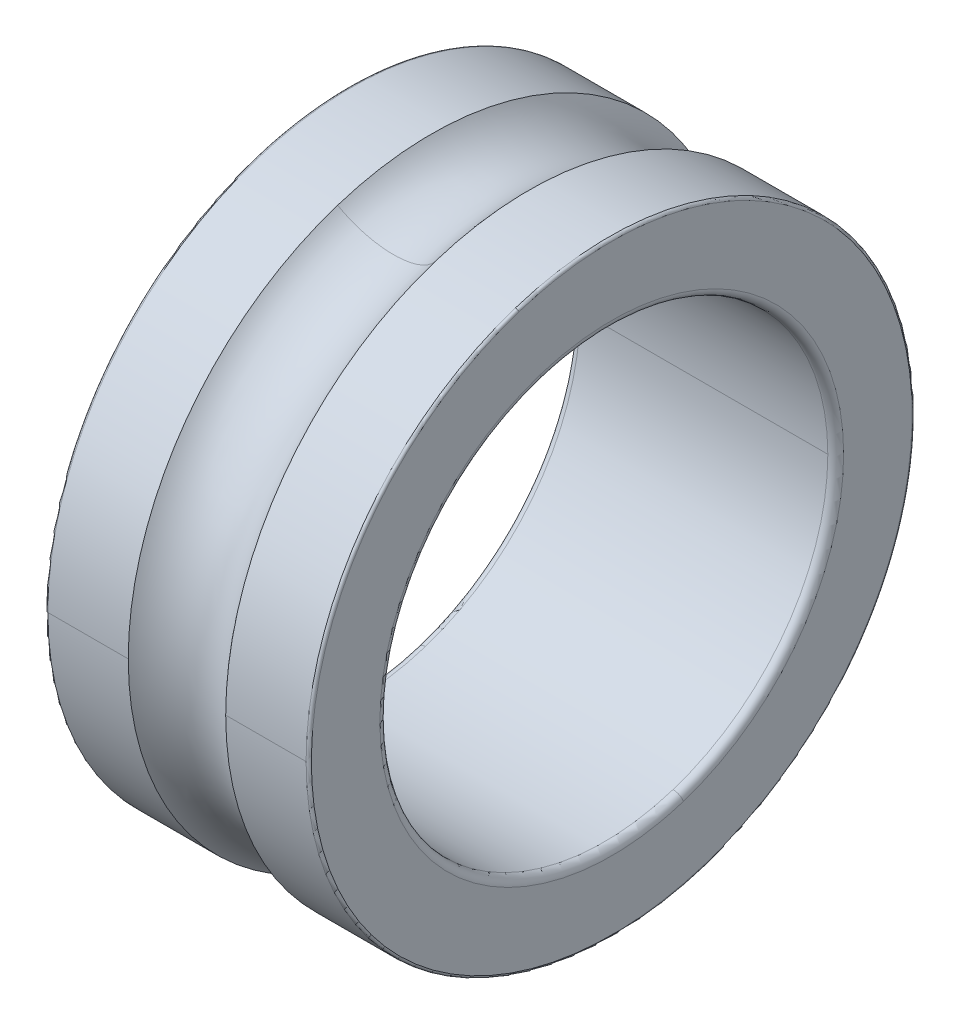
ISO-10303-21;
HEADER;
FILE_DESCRIPTION(('STEP AP214'),'2;1');
FILE_NAME('part.step','',(''),(''),'','','');
FILE_SCHEMA(('AUTOMOTIVE_DESIGN { 1 0 10303 214 1 1 1 1 }'));
ENDSEC;
DATA;
#1=APPLICATION_CONTEXT('core data for automotive mechanical design processes');
#2=APPLICATION_PROTOCOL_DEFINITION('international standard','automotive_design',2000,#1);
#3=PRODUCT_CONTEXT('',#1,'mechanical');
#4=PRODUCT('Part','Part','',(#3));
#5=PRODUCT_RELATED_PRODUCT_CATEGORY('part','',(#4));
#6=PRODUCT_DEFINITION_FORMATION('','',#4);
#7=PRODUCT_DEFINITION_CONTEXT('part definition',#1,'design');
#8=PRODUCT_DEFINITION('design','',#6,#7);
#9=PRODUCT_DEFINITION_SHAPE('','',#8);
#10=(LENGTH_UNIT() NAMED_UNIT(*) SI_UNIT(.MILLI.,.METRE.));
#11=(NAMED_UNIT(*) PLANE_ANGLE_UNIT() SI_UNIT($,.RADIAN.));
#12=(NAMED_UNIT(*) SI_UNIT($,.STERADIAN.) SOLID_ANGLE_UNIT());
#13=UNCERTAINTY_MEASURE_WITH_UNIT(LENGTH_MEASURE(1.E-05),#10,'distance_accuracy_value','');
#14=(GEOMETRIC_REPRESENTATION_CONTEXT(3) GLOBAL_UNCERTAINTY_ASSIGNED_CONTEXT((#13)) GLOBAL_UNIT_ASSIGNED_CONTEXT((#10,
#11,#12)) REPRESENTATION_CONTEXT('',''));
#15=CARTESIAN_POINT('',(0.,0.,0.));
#16=DIRECTION('',(0.,0.,1.));
#17=DIRECTION('',(1.,0.,0.));
#18=AXIS2_PLACEMENT_3D('',#15,#16,#17);
#19=CARTESIAN_POINT('',(0.,11.4,0.));
#20=DIRECTION('',(-1.,0.,0.));
#21=DIRECTION('',(0.,0.,1.));
#22=AXIS2_PLACEMENT_3D('',#19,#20,#21);
#23=PLANE('',#22);
#24=CARTESIAN_POINT('',(0.,0.,0.));
#25=DIRECTION('',(1.,0.,0.));
#26=DIRECTION('',(0.,0.,-1.));
#27=AXIS2_PLACEMENT_3D('',#24,#25,#26);
#28=CIRCLE('',#27,8.8);
#29=CARTESIAN_POINT('',(0.,8.36929734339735,2.71934955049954));
#30=VERTEX_POINT('',#29);
#31=CARTESIAN_POINT('',(0.,-8.36929734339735,-2.71934955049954));
#32=VERTEX_POINT('',#31);
#33=EDGE_CURVE('E11',#30,#32,#28,.T.);
#34=ORIENTED_EDGE('',*,*,#33,.T.);
#35=CARTESIAN_POINT('',(0.,-8.36929734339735,-2.71934955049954));
#36=CARTESIAN_POINT('',(0.,-7.51418773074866,-5.34747265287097));
#37=CARTESIAN_POINT('',(0.,-5.63162629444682,-7.64731028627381));
#38=CARTESIAN_POINT('',(0.,-2.87501454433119,-9.04829744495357));
#39=CARTESIAN_POINT('',(0.,3.05401066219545,-9.39927833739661));
#40=CARTESIAN_POINT('',(0.,7.64439142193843,-5.63033525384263));
#41=CARTESIAN_POINT('',(0.,9.05105758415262,-2.87661710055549));
#42=CARTESIAN_POINT('',(0.,9.22227113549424,0.0905324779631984));
#43=CARTESIAN_POINT('',(0.,8.36929734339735,2.71934955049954));
#44=B_SPLINE_CURVE_WITH_KNOTS('',5,(#35,#36,#37,#38,#39,#40,#41,#42,#43),.UNSPECIFIED.,.F.,.F.,
(6,3,6),(0.,1.5707963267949,3.14159265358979),.UNSPECIFIED.);
#45=EDGE_CURVE('E26',#32,#30,#44,.T.);
#46=ORIENTED_EDGE('',*,*,#45,.T.);
#47=EDGE_LOOP('',(#34,#46));
#48=FACE_BOUND('',#47,.T.);
#49=CARTESIAN_POINT('',(0.,10.8420442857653,3.52279373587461));
#50=CARTESIAN_POINT('',(0.,10.7844064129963,3.70019767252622));
#51=CARTESIAN_POINT('',(0.,10.7224071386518,3.87618414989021));
#52=CARTESIAN_POINT('',(0.,10.5898514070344,4.22490439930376));
#53=CARTESIAN_POINT('',(0.,10.5192949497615,4.39763817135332));
#54=CARTESIAN_POINT('',(0.,10.3697904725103,4.73943522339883));
#55=CARTESIAN_POINT('',(0.,10.2908424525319,4.90849850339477));
#56=CARTESIAN_POINT('',(0.,10.1247462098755,5.2425477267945));
#57=CARTESIAN_POINT('',(0.,10.0375979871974,5.40753367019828));
#58=CARTESIAN_POINT('',(0.,9.85531097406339,5.73303063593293));
#59=CARTESIAN_POINT('',(0.,9.76017218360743,5.89354165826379));
#60=CARTESIAN_POINT('',(0.,9.56213331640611,6.20970212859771));
#61=CARTESIAN_POINT('',(0.,9.45923323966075,6.36535157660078));
#62=CARTESIAN_POINT('',(0.,9.24591967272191,6.67141391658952));
#63=CARTESIAN_POINT('',(0.,9.13550618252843,6.8218268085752));
#64=CARTESIAN_POINT('',(0.,8.90743179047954,7.117053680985));
#65=CARTESIAN_POINT('',(0.,8.78977088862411,7.26186766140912));
#66=CARTESIAN_POINT('',(0.,8.54748512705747,7.54554784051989));
#67=CARTESIAN_POINT('',(0.,8.42286026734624,7.68441403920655));
#68=CARTESIAN_POINT('',(0.,8.1669468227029,7.95586411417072));
#69=CARTESIAN_POINT('',(0.,8.03565823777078,8.08844799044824));
#70=CARTESIAN_POINT('',(0.,7.76673362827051,8.34701401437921));
#71=CARTESIAN_POINT('',(0.,7.62909760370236,8.47299616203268));
#72=CARTESIAN_POINT('',(0.,7.34780969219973,8.71805522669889));
#73=CARTESIAN_POINT('',(0.,7.20415780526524,8.83713214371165));
#74=CARTESIAN_POINT('',(0.,6.91118423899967,9.06809388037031));
#75=CARTESIAN_POINT('',(0.,6.76186255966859,9.17997870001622));
#76=CARTESIAN_POINT('',(0.,6.45790913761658,9.39628670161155));
#77=CARTESIAN_POINT('',(0.,6.30327739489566,9.50070988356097));
#78=CARTESIAN_POINT('',(0.,5.98907636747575,9.7018430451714));
#79=CARTESIAN_POINT('',(0.,5.82950708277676,9.79855302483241));
#80=CARTESIAN_POINT('',(0.,5.50581538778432,9.98402679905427));
#81=CARTESIAN_POINT('',(0.,5.34169297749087,10.0727905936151));
#82=CARTESIAN_POINT('',(0.,5.0092904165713,10.2421581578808));
#83=CARTESIAN_POINT('',(0.,4.84101026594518,10.3227619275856));
#84=CARTESIAN_POINT('',(0.,4.50069762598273,10.4756152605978));
#85=CARTESIAN_POINT('',(0.,4.3286651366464,10.5478648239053));
#86=CARTESIAN_POINT('',(0.,3.98126226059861,10.6838356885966));
#87=CARTESIAN_POINT('',(0.,3.80589187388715,10.7475569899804));
#88=CARTESIAN_POINT('',(0.,3.45223568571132,10.866317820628));
#89=CARTESIAN_POINT('',(0.,3.27394988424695,10.9213573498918));
#90=CARTESIAN_POINT('',(0.,2.91489237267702,11.0226220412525));
#91=CARTESIAN_POINT('',(0.,2.73412066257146,11.0688472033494));
#92=CARTESIAN_POINT('',(0.,2.37052682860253,11.152371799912));
#93=CARTESIAN_POINT('',(0.,2.18770470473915,11.1896712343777));
#94=CARTESIAN_POINT('',(0.,1.8204504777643,11.2552545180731));
#95=CARTESIAN_POINT('',(0.,1.63601837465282,11.2835383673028));
#96=CARTESIAN_POINT('',(0.,1.26598850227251,11.3310223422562));
#97=CARTESIAN_POINT('',(0.,1.08039073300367,11.3502224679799));
#98=CARTESIAN_POINT('',(0.,0.708476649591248,11.3794927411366));
#99=CARTESIAN_POINT('',(0.,0.522160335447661,11.3895628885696));
#100=CARTESIAN_POINT('',(0.,0.149258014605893,11.4005489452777));
#101=CARTESIAN_POINT('',(0.,-0.037327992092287,11.4014648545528));
#102=CARTESIAN_POINT('',(0.,-0.410320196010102,11.3941402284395));
#103=CARTESIAN_POINT('',(0.,-0.596726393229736,11.385899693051));
#104=CARTESIAN_POINT('',(0.,-0.968909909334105,11.3602820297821));
#105=CARTESIAN_POINT('',(0.,-1.15468722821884,11.3429049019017));
#106=CARTESIAN_POINT('',(0.,-1.52516543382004,11.2990559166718));
#107=CARTESIAN_POINT('',(0.,-1.70986632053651,11.2725840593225));
#108=CARTESIAN_POINT('',(0.,-2.07774670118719,11.2106093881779));
#109=CARTESIAN_POINT('',(0.,-2.2609261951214,11.1751065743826));
#110=CARTESIAN_POINT('',(0.,-2.62532249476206,11.0951555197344));
#111=CARTESIAN_POINT('',(0.,-2.8065393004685,11.0507072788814));
#112=CARTESIAN_POINT('',(0.,-3.16657365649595,10.952972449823));
#113=CARTESIAN_POINT('',(0.,-3.34539120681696,10.8996858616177));
#114=CARTESIAN_POINT('',(0.,-3.70019626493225,10.784402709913));
#115=CARTESIAN_POINT('',(0.,-3.87618377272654,10.7224061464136));
#116=CARTESIAN_POINT('',(0.,-4.22490477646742,10.5898523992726));
#117=CARTESIAN_POINT('',(0.,-4.39763827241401,10.5192952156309));
#118=CARTESIAN_POINT('',(0.,-4.73943512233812,10.3697902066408));
#119=CARTESIAN_POINT('',(0.,-4.90849847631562,10.2908423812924));
#120=CARTESIAN_POINT('',(0.,-5.24254775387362,10.124746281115));
#121=CARTESIAN_POINT('',(0.,-5.4075336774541,10.037598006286));
#122=CARTESIAN_POINT('',(0.,-5.73303062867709,9.85531095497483));
#123=CARTESIAN_POINT('',(0.,-5.89354165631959,9.76017217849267));
#124=CARTESIAN_POINT('',(0.,-6.2097021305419,9.56213332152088));
#125=CARTESIAN_POINT('',(0.,-6.36535157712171,9.45923324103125));
#126=CARTESIAN_POINT('',(0.,-6.67141391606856,9.24591967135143));
#127=CARTESIAN_POINT('',(0.,-6.8218268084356,9.13550618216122));
#128=CARTESIAN_POINT('',(0.,-7.11705368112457,8.90743179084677));
#129=CARTESIAN_POINT('',(0.,-7.26186766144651,8.78977088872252));
#130=CARTESIAN_POINT('',(0.,-7.54554784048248,8.54748512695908));
#131=CARTESIAN_POINT('',(0.,-7.68441403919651,8.42286026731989));
#132=CARTESIAN_POINT('',(0.,-7.95586411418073,8.16694682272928));
#133=CARTESIAN_POINT('',(0.,-8.08844799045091,8.03565823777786));
#134=CARTESIAN_POINT('',(0.,-8.34701401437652,7.76673362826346));
#135=CARTESIAN_POINT('',(0.,-8.47299616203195,7.62909760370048));
#136=CARTESIAN_POINT('',(0.,-8.7180552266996,7.34780969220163));
#137=CARTESIAN_POINT('',(0.,-8.83713214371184,7.20415780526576));
#138=CARTESIAN_POINT('',(0.,-9.06809388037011,6.91118423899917));
#139=CARTESIAN_POINT('',(0.,-9.17997870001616,6.76186255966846));
#140=CARTESIAN_POINT('',(0.,-9.3962867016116,6.45790913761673));
#141=CARTESIAN_POINT('',(0.,-9.50070988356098,6.30327739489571));
#142=CARTESIAN_POINT('',(0.,-9.70184304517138,5.98907636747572));
#143=CARTESIAN_POINT('',(0.,-9.7985530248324,5.82950708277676));
#144=CARTESIAN_POINT('',(0.,-9.98402679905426,5.50581538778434));
#145=CARTESIAN_POINT('',(0.,-10.0727905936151,5.34169297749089));
#146=CARTESIAN_POINT('',(0.,-10.2421581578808,5.00929041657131));
#147=CARTESIAN_POINT('',(0.,-10.3227619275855,4.84101026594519));
#148=CARTESIAN_POINT('',(0.,-10.4756152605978,4.50069762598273));
#149=CARTESIAN_POINT('',(0.,-10.5478648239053,4.3286651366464));
#150=CARTESIAN_POINT('',(0.,-10.6838356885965,3.98126226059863));
#151=CARTESIAN_POINT('',(0.,-10.7475569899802,3.8058918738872));
#152=CARTESIAN_POINT('',(0.,-10.8663178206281,3.45223568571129));
#153=CARTESIAN_POINT('',(0.,-10.9213573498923,3.27394988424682));
#154=CARTESIAN_POINT('',(0.,-11.022622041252,2.91489237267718));
#155=CARTESIAN_POINT('',(0.,-11.0688472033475,2.73412066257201));
#156=CARTESIAN_POINT('',(0.,-11.1523717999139,2.37052682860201));
#157=CARTESIAN_POINT('',(0.,-11.1896712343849,2.18770470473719));
#158=CARTESIAN_POINT('',(0.,-11.2552545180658,1.82045047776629));
#159=CARTESIAN_POINT('',(0.,-11.2835383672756,1.63601837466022));
#160=CARTESIAN_POINT('',(0.,-11.3310223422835,1.26598850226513));
#161=CARTESIAN_POINT('',(0.,-11.3502224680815,1.0803907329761));
#162=CARTESIAN_POINT('',(0.,-11.379492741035,0.708476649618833));
#163=CARTESIAN_POINT('',(0.,-11.3895628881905,0.52216033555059));
#164=CARTESIAN_POINT('',(0.,-11.4005489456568,0.149258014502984));
#165=CARTESIAN_POINT('',(0.,-11.4014648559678,-0.0373279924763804));
#166=CARTESIAN_POINT('',(0.,-11.3941402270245,-0.410320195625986));
#167=CARTESIAN_POINT('',(0.,-11.3858996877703,-0.596726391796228));
#168=CARTESIAN_POINT('',(0.,-11.3602820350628,-0.968909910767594));
#169=CARTESIAN_POINT('',(0.,-11.3429049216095,-1.15468723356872));
#170=CARTESIAN_POINT('',(0.,-11.299055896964,-1.52516542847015));
#171=CARTESIAN_POINT('',(0.,-11.2725839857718,-1.70986630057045));
#172=CARTESIAN_POINT('',(0.,-11.2106094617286,-2.07774672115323));
#173=CARTESIAN_POINT('',(0.,-11.1751068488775,-2.26092626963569));
#174=CARTESIAN_POINT('',(0.,-11.0951552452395,-2.62532242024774));
#175=CARTESIAN_POINT('',(0.,-11.0507062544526,-2.80653902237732));
#176=CARTESIAN_POINT('',(0.,-10.9529734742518,-3.16657393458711));
#177=CARTESIAN_POINT('',(0.,-10.899689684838,-3.34539224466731));
#178=CARTESIAN_POINT('',(0.,-10.8420442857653,-3.52279373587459));
#179=B_SPLINE_CURVE_WITH_KNOTS('',3,(#49,#50,#51,#52,#53,#54,#55,#56,#57,#58,#59,#60,#61,#62,
#63,#64,#65,#66,#67,#68,#69,#70,#71,#72,#73,#74,#75,#76,#77,#78,#79,#80,#81,#82,#83,#84,#85,#86,
#87,#88,#89,#90,#91,#92,#93,#94,#95,#96,#97,#98,#99,#100,#101,#102,#103,#104,#105,#106,#107,
#108,#109,#110,#111,#112,#113,#114,#115,#116,#117,#118,#119,#120,#121,#122,#123,#124,#125,#126,
#127,#128,#129,#130,#131,#132,#133,#134,#135,#136,#137,#138,#139,#140,#141,#142,#143,#144,#145,
#146,#147,#148,#149,#150,#151,#152,#153,#154,#155,#156,#157,#158,#159,#160,#161,#162,#163,#164,
#165,#166,#167,#168,#169,#170,#171,#172,#173,#174,#175,#176,#177,#178),.UNSPECIFIED.,.F.,.F.,(4,
2,2,2,2,2,2,2,2,2,2,2,2,2,2,2,2,2,2,2,2,2,2,2,2,2,2,2,2,2,2,2,2,2,2,2,2,2,2,2,2,2,2,2,2,2,2,2,2,
2,2,2,2,2,2,2,2,2,2,2,2,2,2,2,4),(0.,0.559540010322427,1.11908002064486,1.67862003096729,
2.23816004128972,2.79770005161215,3.35724006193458,3.916780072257,4.47632008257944,
5.03586009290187,5.59540010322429,6.15494011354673,6.71448012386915,7.27402013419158,
7.83356014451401,8.39310015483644,8.95264016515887,9.5121801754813,10.0717201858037,
10.6312601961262,11.1908002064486,11.750340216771,12.3098802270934,12.8694202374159,
13.4289602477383,13.9885002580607,14.5480402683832,15.1075802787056,15.667120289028,
16.2266602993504,16.7862003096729,17.3457403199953,17.9052803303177,18.4648203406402,
19.0243603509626,19.583900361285,20.1434403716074,20.7029803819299,21.2625203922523,
21.8220604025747,22.3816004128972,22.9411404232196,23.500680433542,24.0602204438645,
24.6197604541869,25.1793004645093,25.7388404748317,26.2983804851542,26.8579204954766,
27.417460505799,27.9770005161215,28.5365405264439,29.0960805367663,29.6556205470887,
30.2151605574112,30.7747005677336,31.334240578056,31.8937805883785,32.4533205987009,
33.0128606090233,33.5724006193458,34.1319406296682,34.6914806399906,35.251020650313,
35.8105606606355),.UNSPECIFIED.);
#180=CARTESIAN_POINT('',(0.,10.8420442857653,3.52279373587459));
#181=VERTEX_POINT('',#180);
#182=CARTESIAN_POINT('',(0.,-10.8420442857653,-3.52279373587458));
#183=VERTEX_POINT('',#182);
#184=EDGE_CURVE('E330',#181,#183,#179,.T.);
#185=ORIENTED_EDGE('',*,*,#184,.F.);
#186=CARTESIAN_POINT('',(0.,-10.8420442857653,-3.52279373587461));
#187=CARTESIAN_POINT('',(0.,-10.7844064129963,-3.70019767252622));
#188=CARTESIAN_POINT('',(0.,-10.7224071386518,-3.87618414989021));
#189=CARTESIAN_POINT('',(0.,-10.5898514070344,-4.22490439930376));
#190=CARTESIAN_POINT('',(0.,-10.5192949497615,-4.39763817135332));
#191=CARTESIAN_POINT('',(0.,-10.3697904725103,-4.73943522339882));
#192=CARTESIAN_POINT('',(0.,-10.2908424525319,-4.90849850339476));
#193=CARTESIAN_POINT('',(0.,-10.1247462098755,-5.24254772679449));
#194=CARTESIAN_POINT('',(0.,-10.0375979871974,-5.40753367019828));
#195=CARTESIAN_POINT('',(0.,-9.85531097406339,-5.73303063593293));
#196=CARTESIAN_POINT('',(0.,-9.76017218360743,-5.89354165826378));
#197=CARTESIAN_POINT('',(0.,-9.56213331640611,-6.20970212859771));
#198=CARTESIAN_POINT('',(0.,-9.45923323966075,-6.36535157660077));
#199=CARTESIAN_POINT('',(0.,-9.24591967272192,-6.67141391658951));
#200=CARTESIAN_POINT('',(0.,-9.13550618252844,-6.82182680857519));
#201=CARTESIAN_POINT('',(0.,-8.90743179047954,-7.11705368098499));
#202=CARTESIAN_POINT('',(0.,-8.78977088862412,-7.26186766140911));
#203=CARTESIAN_POINT('',(0.,-8.54748512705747,-7.54554784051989));
#204=CARTESIAN_POINT('',(0.,-8.42286026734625,-7.68441403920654));
#205=CARTESIAN_POINT('',(0.,-8.1669468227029,-7.95586411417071));
#206=CARTESIAN_POINT('',(0.,-8.03565823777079,-8.08844799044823));
#207=CARTESIAN_POINT('',(0.,-7.76673362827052,-8.34701401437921));
#208=CARTESIAN_POINT('',(0.,-7.62909760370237,-8.47299616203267));
#209=CARTESIAN_POINT('',(0.,-7.34780969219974,-8.71805522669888));
#210=CARTESIAN_POINT('',(0.,-7.20415780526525,-8.83713214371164));
#211=CARTESIAN_POINT('',(0.,-6.91118423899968,-9.0680938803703));
#212=CARTESIAN_POINT('',(0.,-6.7618625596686,-9.17997870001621));
#213=CARTESIAN_POINT('',(0.,-6.45790913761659,-9.39628670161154));
#214=CARTESIAN_POINT('',(0.,-6.30327739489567,-9.50070988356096));
#215=CARTESIAN_POINT('',(0.,-5.98907636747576,-9.70184304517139));
#216=CARTESIAN_POINT('',(0.,-5.82950708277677,-9.7985530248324));
#217=CARTESIAN_POINT('',(0.,-5.50581538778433,-9.98402679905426));
#218=CARTESIAN_POINT('',(0.,-5.34169297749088,-10.0727905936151));
#219=CARTESIAN_POINT('',(0.,-5.00929041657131,-10.2421581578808));
#220=CARTESIAN_POINT('',(0.,-4.84101026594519,-10.3227619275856));
#221=CARTESIAN_POINT('',(0.,-4.50069762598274,-10.4756152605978));
#222=CARTESIAN_POINT('',(0.,-4.32866513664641,-10.5478648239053));
#223=CARTESIAN_POINT('',(0.,-3.98126226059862,-10.6838356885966));
#224=CARTESIAN_POINT('',(0.,-3.80589187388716,-10.7475569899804));
#225=CARTESIAN_POINT('',(0.,-3.45223568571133,-10.866317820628));
#226=CARTESIAN_POINT('',(0.,-3.27394988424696,-10.9213573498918));
#227=CARTESIAN_POINT('',(0.,-2.91489237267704,-11.0226220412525));
#228=CARTESIAN_POINT('',(0.,-2.73412066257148,-11.0688472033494));
#229=CARTESIAN_POINT('',(0.,-2.37052682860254,-11.152371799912));
#230=CARTESIAN_POINT('',(0.,-2.18770470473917,-11.1896712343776));
#231=CARTESIAN_POINT('',(0.,-1.82045047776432,-11.2552545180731));
#232=CARTESIAN_POINT('',(0.,-1.63601837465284,-11.2835383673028));
#233=CARTESIAN_POINT('',(0.,-1.26598850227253,-11.3310223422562));
#234=CARTESIAN_POINT('',(0.,-1.08039073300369,-11.3502224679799));
#235=CARTESIAN_POINT('',(0.,-0.708476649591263,-11.3794927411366));
#236=CARTESIAN_POINT('',(0.,-0.522160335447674,-11.3895628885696));
#237=CARTESIAN_POINT('',(0.,-0.149258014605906,-11.4005489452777));
#238=CARTESIAN_POINT('',(0.,0.0373279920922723,-11.4014648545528));
#239=CARTESIAN_POINT('',(0.,0.410320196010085,-11.3941402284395));
#240=CARTESIAN_POINT('',(0.,0.59672639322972,-11.385899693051));
#241=CARTESIAN_POINT('',(0.,0.968909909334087,-11.3602820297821));
#242=CARTESIAN_POINT('',(0.,1.15468722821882,-11.3429049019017));
#243=CARTESIAN_POINT('',(0.,1.52516543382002,-11.2990559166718));
#244=CARTESIAN_POINT('',(0.,1.70986632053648,-11.2725840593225));
#245=CARTESIAN_POINT('',(0.,2.07774670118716,-11.2106093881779));
#246=CARTESIAN_POINT('',(0.,2.26092619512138,-11.1751065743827));
#247=CARTESIAN_POINT('',(0.,2.62532249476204,-11.0951555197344));
#248=CARTESIAN_POINT('',(0.,2.80653930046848,-11.0507072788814));
#249=CARTESIAN_POINT('',(0.,3.16657365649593,-10.952972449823));
#250=CARTESIAN_POINT('',(0.,3.34539120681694,-10.8996858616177));
#251=CARTESIAN_POINT('',(0.,3.70019626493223,-10.784402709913));
#252=CARTESIAN_POINT('',(0.,3.87618377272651,-10.7224061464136));
#253=CARTESIAN_POINT('',(0.,4.22490477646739,-10.5898523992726));
#254=CARTESIAN_POINT('',(0.,4.39763827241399,-10.5192952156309));
#255=CARTESIAN_POINT('',(0.,4.7394351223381,-10.3697902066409));
#256=CARTESIAN_POINT('',(0.,4.90849847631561,-10.2908423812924));
#257=CARTESIAN_POINT('',(0.,5.2425477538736,-10.124746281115));
#258=CARTESIAN_POINT('',(0.,5.40753367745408,-10.037598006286));
#259=CARTESIAN_POINT('',(0.,5.73303062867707,-9.85531095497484));
#260=CARTESIAN_POINT('',(0.,5.89354165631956,-9.76017217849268));
#261=CARTESIAN_POINT('',(0.,6.20970213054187,-9.56213332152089));
#262=CARTESIAN_POINT('',(0.,6.36535157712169,-9.45923324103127));
#263=CARTESIAN_POINT('',(0.,6.67141391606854,-9.24591967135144));
#264=CARTESIAN_POINT('',(0.,6.82182680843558,-9.13550618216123));
#265=CARTESIAN_POINT('',(0.,7.11705368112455,-8.90743179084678));
#266=CARTESIAN_POINT('',(0.,7.26186766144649,-8.78977088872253));
#267=CARTESIAN_POINT('',(0.,7.54554784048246,-8.54748512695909));
#268=CARTESIAN_POINT('',(0.,7.68441403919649,-8.4228602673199));
#269=CARTESIAN_POINT('',(0.,7.95586411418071,-8.16694682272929));
#270=CARTESIAN_POINT('',(0.,8.0884479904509,-8.03565823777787));
#271=CARTESIAN_POINT('',(0.,8.3470140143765,-7.76673362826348));
#272=CARTESIAN_POINT('',(0.,8.47299616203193,-7.6290976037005));
#273=CARTESIAN_POINT('',(0.,8.71805522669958,-7.34780969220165));
#274=CARTESIAN_POINT('',(0.,8.83713214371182,-7.20415780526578));
#275=CARTESIAN_POINT('',(0.,9.0680938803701,-6.9111842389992));
#276=CARTESIAN_POINT('',(0.,9.17997870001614,-6.76186255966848));
#277=CARTESIAN_POINT('',(0.,9.39628670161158,-6.45790913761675));
#278=CARTESIAN_POINT('',(0.,9.50070988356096,-6.30327739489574));
#279=CARTESIAN_POINT('',(0.,9.70184304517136,-5.98907636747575));
#280=CARTESIAN_POINT('',(0.,9.79855302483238,-5.82950708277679));
#281=CARTESIAN_POINT('',(0.,9.98402679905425,-5.50581538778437));
#282=CARTESIAN_POINT('',(0.,10.0727905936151,-5.34169297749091));
#283=CARTESIAN_POINT('',(0.,10.2421581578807,-5.00929041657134));
#284=CARTESIAN_POINT('',(0.,10.3227619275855,-4.84101026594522));
#285=CARTESIAN_POINT('',(0.,10.4756152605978,-4.50069762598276));
#286=CARTESIAN_POINT('',(0.,10.5478648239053,-4.32866513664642));
#287=CARTESIAN_POINT('',(0.,10.6838356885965,-3.98126226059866));
#288=CARTESIAN_POINT('',(0.,10.7475569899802,-3.80589187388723));
#289=CARTESIAN_POINT('',(0.,10.8663178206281,-3.45223568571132));
#290=CARTESIAN_POINT('',(0.,10.9213573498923,-3.27394988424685));
#291=CARTESIAN_POINT('',(0.,11.022622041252,-2.91489237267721));
#292=CARTESIAN_POINT('',(0.,11.0688472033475,-2.73412066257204));
#293=CARTESIAN_POINT('',(0.,11.1523717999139,-2.37052682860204));
#294=CARTESIAN_POINT('',(0.,11.1896712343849,-2.18770470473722));
#295=CARTESIAN_POINT('',(0.,11.2552545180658,-1.82045047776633));
#296=CARTESIAN_POINT('',(0.,11.2835383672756,-1.63601837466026));
#297=CARTESIAN_POINT('',(0.,11.3310223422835,-1.26598850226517));
#298=CARTESIAN_POINT('',(0.,11.3502224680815,-1.08039073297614));
#299=CARTESIAN_POINT('',(0.,11.379492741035,-0.708476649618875));
#300=CARTESIAN_POINT('',(0.,11.3895628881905,-0.522160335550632));
#301=CARTESIAN_POINT('',(0.,11.4005489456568,-0.149258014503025));
#302=CARTESIAN_POINT('',(0.,11.4014648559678,0.0373279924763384));
#303=CARTESIAN_POINT('',(0.,11.3941402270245,0.410320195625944));
#304=CARTESIAN_POINT('',(0.,11.3858996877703,0.596726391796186));
#305=CARTESIAN_POINT('',(0.,11.3602820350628,0.968909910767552));
#306=CARTESIAN_POINT('',(0.,11.3429049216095,1.15468723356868));
#307=CARTESIAN_POINT('',(0.,11.299055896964,1.52516542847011));
#308=CARTESIAN_POINT('',(0.,11.2725839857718,1.70986630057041));
#309=CARTESIAN_POINT('',(0.,11.2106094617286,2.07774672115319));
#310=CARTESIAN_POINT('',(0.,11.1751068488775,2.26092626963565));
#311=CARTESIAN_POINT('',(0.,11.0951552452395,2.6253224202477));
#312=CARTESIAN_POINT('',(0.,11.0507062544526,2.80653902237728));
#313=CARTESIAN_POINT('',(0.,10.9529734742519,3.16657393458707));
#314=CARTESIAN_POINT('',(0.,10.8996896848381,3.34539224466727));
#315=CARTESIAN_POINT('',(0.,10.8420442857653,3.52279373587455));
#316=B_SPLINE_CURVE_WITH_KNOTS('',3,(#186,#187,#188,#189,#190,#191,#192,#193,#194,#195,#196,
#197,#198,#199,#200,#201,#202,#203,#204,#205,#206,#207,#208,#209,#210,#211,#212,#213,#214,#215,
#216,#217,#218,#219,#220,#221,#222,#223,#224,#225,#226,#227,#228,#229,#230,#231,#232,#233,#234,
#235,#236,#237,#238,#239,#240,#241,#242,#243,#244,#245,#246,#247,#248,#249,#250,#251,#252,#253,
#254,#255,#256,#257,#258,#259,#260,#261,#262,#263,#264,#265,#266,#267,#268,#269,#270,#271,#272,
#273,#274,#275,#276,#277,#278,#279,#280,#281,#282,#283,#284,#285,#286,#287,#288,#289,#290,#291,
#292,#293,#294,#295,#296,#297,#298,#299,#300,#301,#302,#303,#304,#305,#306,#307,#308,#309,#310,
#311,#312,#313,#314,#315),.UNSPECIFIED.,.F.,.F.,(4,2,2,2,2,2,2,2,2,2,2,2,2,2,2,2,2,2,2,2,2,2,2,
2,2,2,2,2,2,2,2,2,2,2,2,2,2,2,2,2,2,2,2,2,2,2,2,2,2,2,2,2,2,2,2,2,2,2,2,2,2,2,2,2,4),(0.,
0.559540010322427,1.11908002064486,1.67862003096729,2.23816004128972,2.79770005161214,
3.35724006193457,3.916780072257,4.47632008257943,5.03586009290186,5.59540010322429,
6.15494011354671,6.71448012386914,7.27402013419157,7.833560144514,8.39310015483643,
8.95264016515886,9.51218017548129,10.0717201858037,10.6312601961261,11.1908002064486,
11.750340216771,12.3098802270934,12.8694202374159,13.4289602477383,13.9885002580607,
14.5480402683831,15.1075802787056,15.667120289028,16.2266602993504,16.7862003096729,
17.3457403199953,17.9052803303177,18.4648203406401,19.0243603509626,19.583900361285,
20.1434403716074,20.7029803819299,21.2625203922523,21.8220604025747,22.3816004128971,
22.9411404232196,23.500680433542,24.0602204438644,24.6197604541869,25.1793004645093,
25.7388404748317,26.2983804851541,26.8579204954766,27.417460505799,27.9770005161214,
28.5365405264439,29.0960805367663,29.6556205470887,30.2151605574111,30.7747005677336,
31.334240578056,31.8937805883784,32.4533205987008,33.0128606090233,33.5724006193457,
34.1319406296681,34.6914806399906,35.251020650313,35.8105606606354),.UNSPECIFIED.);
#317=EDGE_CURVE('E436',#183,#181,#316,.T.);
#318=ORIENTED_EDGE('',*,*,#317,.F.);
#319=EDGE_LOOP('',(#185,#318));
#320=FACE_BOUND('',#319,.T.);
#321=ADVANCED_FACE('F17',(#48,#320),#23,.T.);
#322=CARTESIAN_POINT('',(0.0999999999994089,0.,0.));
#323=DIRECTION('',(1.,0.,0.));
#324=DIRECTION('',(0.,-0.309016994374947,0.951056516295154));
#325=AXIS2_PLACEMENT_3D('',#322,#323,#324);
#326=TOROIDAL_SURFACE('',#325,11.4000000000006,0.0999999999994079);
#327=CARTESIAN_POINT('',(0.0999999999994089,-10.8420442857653,-3.52279373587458));
#328=DIRECTION('',(0.,0.309016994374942,-0.951056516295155));
#329=DIRECTION('',(5.94038707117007E-12,-0.951056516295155,-0.309016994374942));
#330=AXIS2_PLACEMENT_3D('',#327,#328,#329);
#331=CIRCLE('',#330,0.0999999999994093);
#332=CARTESIAN_POINT('',(0.100000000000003,-10.9371499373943,-3.5536954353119));
#333=VERTEX_POINT('',#332);
#334=EDGE_CURVE('E402',#333,#183,#331,.T.);
#335=ORIENTED_EDGE('',*,*,#334,.T.);
#336=ORIENTED_EDGE('',*,*,#317,.T.);
#337=CARTESIAN_POINT('',(0.0999999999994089,10.8420442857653,3.52279373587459));
#338=DIRECTION('',(0.,-0.309016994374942,0.951056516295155));
#339=DIRECTION('',(5.94038707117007E-12,0.951056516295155,0.309016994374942));
#340=AXIS2_PLACEMENT_3D('',#337,#338,#339);
#341=CIRCLE('',#340,0.0999999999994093);
#342=CARTESIAN_POINT('',(0.100000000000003,10.9371499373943,3.5536954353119));
#343=VERTEX_POINT('',#342);
#344=EDGE_CURVE('E398',#343,#181,#341,.T.);
#345=ORIENTED_EDGE('',*,*,#344,.F.);
#346=CARTESIAN_POINT('',(0.100000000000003,0.,0.));
#347=DIRECTION('',(1.,0.,0.));
#348=DIRECTION('',(0.,0.,-1.));
#349=AXIS2_PLACEMENT_3D('',#346,#347,#348);
#350=CIRCLE('',#349,11.5);
#351=CARTESIAN_POINT('',(0.100000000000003,0.,-11.5));
#352=VERTEX_POINT('',#351);
#353=EDGE_CURVE('E393',#352,#343,#350,.T.);
#354=ORIENTED_EDGE('',*,*,#353,.F.);
#355=CARTESIAN_POINT('',(0.100000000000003,0.,0.));
#356=DIRECTION('',(1.,0.,0.));
#357=DIRECTION('',(0.,0.,-1.));
#358=AXIS2_PLACEMENT_3D('',#355,#356,#357);
#359=CIRCLE('',#358,11.5);
#360=EDGE_CURVE('E388',#333,#352,#359,.T.);
#361=ORIENTED_EDGE('',*,*,#360,.F.);
#362=EDGE_LOOP('',(#335,#336,#345,#354,#361));
#363=FACE_BOUND('',#362,.T.);
#364=ADVANCED_FACE('F410',(#363),#326,.T.);
#365=CARTESIAN_POINT('',(100.,0.,0.));
#366=DIRECTION('',(1.,0.,0.));
#367=DIRECTION('',(0.,1.,0.));
#368=AXIS2_PLACEMENT_3D('',#365,#366,#367);
#369=CYLINDRICAL_SURFACE('',#368,11.5);
#370=DIRECTION('',(1.,0.,0.));
#371=VECTOR('',#370,1.);
#372=CARTESIAN_POINT('',(0.100000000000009,0.,11.5));
#373=LINE('',#372,#371);
#374=CARTESIAN_POINT('',(0.100000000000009,0.,11.5));
#375=VERTEX_POINT('',#374);
#376=CARTESIAN_POINT('',(3.15090265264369,0.,11.5));
#377=VERTEX_POINT('',#376);
#378=EDGE_CURVE('E383',#375,#377,#373,.T.);
#379=ORIENTED_EDGE('',*,*,#378,.F.);
#380=CARTESIAN_POINT('',(0.100000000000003,0.,0.));
#381=DIRECTION('',(1.,0.,0.));
#382=DIRECTION('',(0.,0.,-1.));
#383=AXIS2_PLACEMENT_3D('',#380,#381,#382);
#384=CIRCLE('',#383,11.5);
#385=EDGE_CURVE('E378',#375,#333,#384,.T.);
#386=ORIENTED_EDGE('',*,*,#385,.T.);
#387=ORIENTED_EDGE('',*,*,#360,.T.);
#388=DIRECTION('',(1.,0.,0.));
#389=VECTOR('',#388,1.);
#390=CARTESIAN_POINT('',(0.100000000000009,0.,-11.5));
#391=LINE('',#390,#389);
#392=CARTESIAN_POINT('',(3.1509026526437,0.,-11.5));
#393=VERTEX_POINT('',#392);
#394=EDGE_CURVE('E374',#352,#393,#391,.T.);
#395=ORIENTED_EDGE('',*,*,#394,.T.);
#396=CARTESIAN_POINT('',(3.1509026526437,0.,0.));
#397=DIRECTION('',(1.,0.,0.));
#398=DIRECTION('',(0.,0.,-1.));
#399=AXIS2_PLACEMENT_3D('',#396,#397,#398);
#400=CIRCLE('',#399,11.5);
#401=CARTESIAN_POINT('',(3.15090265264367,-10.9371499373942,-3.55369543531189));
#402=VERTEX_POINT('',#401);
#403=EDGE_CURVE('E369',#402,#393,#400,.T.);
#404=ORIENTED_EDGE('',*,*,#403,.F.);
#405=CARTESIAN_POINT('',(3.1509026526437,0.,0.));
#406=DIRECTION('',(1.,0.,0.));
#407=DIRECTION('',(0.,0.,-1.));
#408=AXIS2_PLACEMENT_3D('',#405,#406,#407);
#409=CIRCLE('',#408,11.5);
#410=EDGE_CURVE('E364',#377,#402,#409,.T.);
#411=ORIENTED_EDGE('',*,*,#410,.F.);
#412=EDGE_LOOP('',(#379,#386,#387,#395,#404,#411));
#413=FACE_BOUND('',#412,.T.);
#414=ADVANCED_FACE('F419',(#413),#369,.T.);
#415=CARTESIAN_POINT('',(5.,0.,0.));
#416=DIRECTION('',(1.,0.,0.));
#417=DIRECTION('',(0.,0.309016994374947,-0.951056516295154));
#418=AXIS2_PLACEMENT_3D('',#415,#416,#417);
#419=TOROIDAL_SURFACE('',#418,13.,2.38100000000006);
#420=CARTESIAN_POINT('',(5.,-12.363734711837,-4.01722092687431));
#421=DIRECTION('',(0.,0.309016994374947,-0.951056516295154));
#422=DIRECTION('',(-0.776605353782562,0.599153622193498,0.194676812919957));
#423=AXIS2_PLACEMENT_3D('',#420,#421,#422);
#424=CIRCLE('',#423,2.38100000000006);
#425=CARTESIAN_POINT('',(6.84909734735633,-10.9371499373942,-3.55369543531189));
#426=VERTEX_POINT('',#425);
#427=EDGE_CURVE('E360',#402,#426,#424,.T.);
#428=ORIENTED_EDGE('',*,*,#427,.T.);
#429=CARTESIAN_POINT('',(6.8490973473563,0.,0.));
#430=DIRECTION('',(1.,0.,0.));
#431=DIRECTION('',(0.,0.,-1.));
#432=AXIS2_PLACEMENT_3D('',#429,#430,#431);
#433=CIRCLE('',#432,11.5);
#434=CARTESIAN_POINT('',(6.84909734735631,0.,11.5));
#435=VERTEX_POINT('',#434);
#436=EDGE_CURVE('E355',#435,#426,#433,.T.);
#437=ORIENTED_EDGE('',*,*,#436,.F.);
#438=CARTESIAN_POINT('',(6.8490973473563,0.,0.));
#439=DIRECTION('',(1.,0.,0.));
#440=DIRECTION('',(0.,0.,-1.));
#441=AXIS2_PLACEMENT_3D('',#438,#439,#440);
#442=CIRCLE('',#441,11.5);
#443=CARTESIAN_POINT('',(6.84909734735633,10.9371499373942,3.55369543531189));
#444=VERTEX_POINT('',#443);
#445=EDGE_CURVE('E350',#444,#435,#442,.T.);
#446=ORIENTED_EDGE('',*,*,#445,.F.);
#447=CARTESIAN_POINT('',(5.,12.363734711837,4.01722092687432));
#448=DIRECTION('',(0.,-0.309016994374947,0.951056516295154));
#449=DIRECTION('',(-0.776605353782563,-0.599153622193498,-0.194676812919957));
#450=AXIS2_PLACEMENT_3D('',#447,#448,#449);
#451=CIRCLE('',#450,2.38100000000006);
#452=CARTESIAN_POINT('',(3.15090265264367,10.9371499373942,3.55369543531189));
#453=VERTEX_POINT('',#452);
#454=EDGE_CURVE('E345',#453,#444,#451,.T.);
#455=ORIENTED_EDGE('',*,*,#454,.F.);
#456=CARTESIAN_POINT('',(3.1509026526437,0.,0.));
#457=DIRECTION('',(1.,0.,0.));
#458=DIRECTION('',(0.,0.,-1.));
#459=AXIS2_PLACEMENT_3D('',#456,#457,#458);
#460=CIRCLE('',#459,11.5);
#461=EDGE_CURVE('E340',#453,#377,#460,.T.);
#462=ORIENTED_EDGE('',*,*,#461,.T.);
#463=ORIENTED_EDGE('',*,*,#410,.T.);
#464=EDGE_LOOP('',(#428,#437,#446,#455,#462,#463));
#465=FACE_BOUND('',#464,.T.);
#466=ADVANCED_FACE('F422',(#465),#419,.F.);
#467=CARTESIAN_POINT('',(100.,0.,0.));
#468=DIRECTION('',(1.,0.,0.));
#469=DIRECTION('',(0.,-1.,0.));
#470=AXIS2_PLACEMENT_3D('',#467,#468,#469);
#471=CYLINDRICAL_SURFACE('',#470,11.5);
#472=ORIENTED_EDGE('',*,*,#378,.T.);
#473=ORIENTED_EDGE('',*,*,#461,.F.);
#474=CARTESIAN_POINT('',(3.1509026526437,0.,0.));
#475=DIRECTION('',(1.,0.,0.));
#476=DIRECTION('',(0.,0.,-1.));
#477=AXIS2_PLACEMENT_3D('',#474,#475,#476);
#478=CIRCLE('',#477,11.5);
#479=EDGE_CURVE('E334',#393,#453,#478,.T.);
#480=ORIENTED_EDGE('',*,*,#479,.F.);
#481=ORIENTED_EDGE('',*,*,#394,.F.);
#482=ORIENTED_EDGE('',*,*,#353,.T.);
#483=CARTESIAN_POINT('',(0.100000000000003,0.,0.));
#484=DIRECTION('',(1.,0.,0.));
#485=DIRECTION('',(0.,0.,-1.));
#486=AXIS2_PLACEMENT_3D('',#483,#484,#485);
#487=CIRCLE('',#486,11.5);
#488=EDGE_CURVE('E331',#343,#375,#487,.T.);
#489=ORIENTED_EDGE('',*,*,#488,.T.);
#490=EDGE_LOOP('',(#472,#473,#480,#481,#482,#489));
#491=FACE_BOUND('',#490,.T.);
#492=ADVANCED_FACE('F311',(#491),#471,.T.);
#493=CARTESIAN_POINT('',(0.0999999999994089,0.,0.));
#494=DIRECTION('',(1.,0.,0.));
#495=DIRECTION('',(0.,0.309016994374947,-0.951056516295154));
#496=AXIS2_PLACEMENT_3D('',#493,#494,#495);
#497=TOROIDAL_SURFACE('',#496,11.4000000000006,0.0999999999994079);
#498=ORIENTED_EDGE('',*,*,#334,.F.);
#499=ORIENTED_EDGE('',*,*,#385,.F.);
#500=ORIENTED_EDGE('',*,*,#488,.F.);
#501=ORIENTED_EDGE('',*,*,#344,.T.);
#502=ORIENTED_EDGE('',*,*,#184,.T.);
#503=EDGE_LOOP('',(#498,#499,#500,#501,#502));
#504=FACE_BOUND('',#503,.T.);
#505=ADVANCED_FACE('F306',(#504),#497,.T.);
#506=CARTESIAN_POINT('',(5.,0.,0.));
#507=DIRECTION('',(1.,0.,0.));
#508=DIRECTION('',(0.,-0.309016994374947,0.951056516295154));
#509=AXIS2_PLACEMENT_3D('',#506,#507,#508);
#510=TOROIDAL_SURFACE('',#509,13.,2.38100000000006);
#511=ORIENTED_EDGE('',*,*,#427,.F.);
#512=ORIENTED_EDGE('',*,*,#403,.T.);
#513=ORIENTED_EDGE('',*,*,#479,.T.);
#514=ORIENTED_EDGE('',*,*,#454,.T.);
#515=CARTESIAN_POINT('',(6.8490973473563,0.,0.));
#516=DIRECTION('',(1.,0.,0.));
#517=DIRECTION('',(0.,0.,-1.));
#518=AXIS2_PLACEMENT_3D('',#515,#516,#517);
#519=CIRCLE('',#518,11.5);
#520=CARTESIAN_POINT('',(6.8490973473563,0.,-11.5));
#521=VERTEX_POINT('',#520);
#522=EDGE_CURVE('E335',#521,#444,#519,.T.);
#523=ORIENTED_EDGE('',*,*,#522,.F.);
#524=CARTESIAN_POINT('',(6.8490973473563,0.,0.));
#525=DIRECTION('',(1.,0.,0.));
#526=DIRECTION('',(0.,0.,-1.));
#527=AXIS2_PLACEMENT_3D('',#524,#525,#526);
#528=CIRCLE('',#527,11.5);
#529=EDGE_CURVE('E466',#426,#521,#528,.T.);
#530=ORIENTED_EDGE('',*,*,#529,.F.);
#531=EDGE_LOOP('',(#511,#512,#513,#514,#523,#530));
#532=FACE_BOUND('',#531,.T.);
#533=ADVANCED_FACE('F302',(#532),#510,.F.);
#534=CARTESIAN_POINT('',(100.,0.,0.));
#535=DIRECTION('',(1.,0.,0.));
#536=DIRECTION('',(0.,1.,0.));
#537=AXIS2_PLACEMENT_3D('',#534,#535,#536);
#538=CYLINDRICAL_SURFACE('',#537,11.5);
#539=DIRECTION('',(1.,0.,0.));
#540=VECTOR('',#539,1.);
#541=CARTESIAN_POINT('',(6.84909734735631,0.,11.5));
#542=LINE('',#541,#540);
#543=CARTESIAN_POINT('',(9.90000000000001,0.,11.5));
#544=VERTEX_POINT('',#543);
#545=EDGE_CURVE('E472',#435,#544,#542,.T.);
#546=ORIENTED_EDGE('',*,*,#545,.F.);
#547=ORIENTED_EDGE('',*,*,#436,.T.);
#548=ORIENTED_EDGE('',*,*,#529,.T.);
#549=DIRECTION('',(1.,0.,0.));
#550=VECTOR('',#549,1.);
#551=CARTESIAN_POINT('',(6.84909734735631,0.,-11.5));
#552=LINE('',#551,#550);
#553=CARTESIAN_POINT('',(9.9,0.,-11.5));
#554=VERTEX_POINT('',#553);
#555=EDGE_CURVE('E470',#521,#554,#552,.T.);
#556=ORIENTED_EDGE('',*,*,#555,.T.);
#557=CARTESIAN_POINT('',(9.9,0.,0.));
#558=DIRECTION('',(1.,0.,0.));
#559=DIRECTION('',(0.,0.,-1.));
#560=AXIS2_PLACEMENT_3D('',#557,#558,#559);
#561=CIRCLE('',#560,11.5);
#562=CARTESIAN_POINT('',(9.9,-10.9371499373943,-3.55369543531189));
#563=VERTEX_POINT('',#562);
#564=EDGE_CURVE('E479',#563,#554,#561,.T.);
#565=ORIENTED_EDGE('',*,*,#564,.F.);
#566=CARTESIAN_POINT('',(9.9,0.,0.));
#567=DIRECTION('',(1.,0.,0.));
#568=DIRECTION('',(0.,0.,-1.));
#569=AXIS2_PLACEMENT_3D('',#566,#567,#568);
#570=CIRCLE('',#569,11.5);
#571=EDGE_CURVE('E482',#544,#563,#570,.T.);
#572=ORIENTED_EDGE('',*,*,#571,.F.);
#573=EDGE_LOOP('',(#546,#547,#548,#556,#565,#572));
#574=FACE_BOUND('',#573,.T.);
#575=ADVANCED_FACE('F298',(#574),#538,.T.);
#576=CARTESIAN_POINT('',(9.90000000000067,0.,0.));
#577=DIRECTION('',(1.,0.,0.));
#578=DIRECTION('',(0.,0.309016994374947,-0.951056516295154));
#579=AXIS2_PLACEMENT_3D('',#576,#577,#578);
#580=TOROIDAL_SURFACE('',#579,11.4000000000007,0.099999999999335);
#581=CARTESIAN_POINT('',(9.90000000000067,-10.8420442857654,-3.5227937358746));
#582=DIRECTION('',(0.,0.309016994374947,-0.951056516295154));
#583=DIRECTION('',(1.,0.,0.));
#584=AXIS2_PLACEMENT_3D('',#581,#582,#583);
#585=CIRCLE('',#584,0.0999999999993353);
#586=CARTESIAN_POINT('',(10.,-10.8420442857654,-3.5227937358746));
#587=VERTEX_POINT('',#586);
#588=EDGE_CURVE('E497',#587,#563,#585,.T.);
#589=ORIENTED_EDGE('',*,*,#588,.F.);
#590=CARTESIAN_POINT('',(10.,0.,0.));
#591=DIRECTION('',(1.,0.,0.));
#592=DIRECTION('',(0.,0.,-1.));
#593=AXIS2_PLACEMENT_3D('',#590,#591,#592);
#594=CIRCLE('',#593,11.4);
#595=CARTESIAN_POINT('',(10.,10.8420442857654,3.5227937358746));
#596=VERTEX_POINT('',#595);
#597=EDGE_CURVE('E502',#596,#587,#594,.T.);
#598=ORIENTED_EDGE('',*,*,#597,.F.);
#599=CARTESIAN_POINT('',(9.90000000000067,10.8420442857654,3.5227937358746));
#600=DIRECTION('',(0.,-0.309016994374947,0.951056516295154));
#601=DIRECTION('',(1.,0.,0.));
#602=AXIS2_PLACEMENT_3D('',#599,#600,#601);
#603=CIRCLE('',#602,0.0999999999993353);
#604=CARTESIAN_POINT('',(9.9,10.9371499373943,3.55369543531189));
#605=VERTEX_POINT('',#604);
#606=EDGE_CURVE('E506',#596,#605,#603,.T.);
#607=ORIENTED_EDGE('',*,*,#606,.T.);
#608=CARTESIAN_POINT('',(9.9,0.,0.));
#609=DIRECTION('',(1.,0.,0.));
#610=DIRECTION('',(0.,0.,-1.));
#611=AXIS2_PLACEMENT_3D('',#608,#609,#610);
#612=CIRCLE('',#611,11.5);
#613=EDGE_CURVE('E510',#605,#544,#612,.T.);
#614=ORIENTED_EDGE('',*,*,#613,.T.);
#615=ORIENTED_EDGE('',*,*,#571,.T.);
#616=EDGE_LOOP('',(#589,#598,#607,#614,#615));
#617=FACE_BOUND('',#616,.T.);
#618=ADVANCED_FACE('F294',(#617),#580,.T.);
#619=CARTESIAN_POINT('',(100.,0.,0.));
#620=DIRECTION('',(1.,0.,0.));
#621=DIRECTION('',(0.,-1.,0.));
#622=AXIS2_PLACEMENT_3D('',#619,#620,#621);
#623=CYLINDRICAL_SURFACE('',#622,11.5);
#624=ORIENTED_EDGE('',*,*,#545,.T.);
#625=ORIENTED_EDGE('',*,*,#613,.F.);
#626=CARTESIAN_POINT('',(9.9,0.,0.));
#627=DIRECTION('',(1.,0.,0.));
#628=DIRECTION('',(0.,0.,-1.));
#629=AXIS2_PLACEMENT_3D('',#626,#627,#628);
#630=CIRCLE('',#629,11.5);
#631=EDGE_CURVE('E477',#554,#605,#630,.T.);
#632=ORIENTED_EDGE('',*,*,#631,.F.);
#633=ORIENTED_EDGE('',*,*,#555,.F.);
#634=ORIENTED_EDGE('',*,*,#522,.T.);
#635=ORIENTED_EDGE('',*,*,#445,.T.);
#636=EDGE_LOOP('',(#624,#625,#632,#633,#634,#635));
#637=FACE_BOUND('',#636,.T.);
#638=ADVANCED_FACE('F290',(#637),#623,.T.);
#639=CARTESIAN_POINT('',(9.90000000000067,0.,0.));
#640=DIRECTION('',(1.,0.,0.));
#641=DIRECTION('',(0.,-0.309016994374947,0.951056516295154));
#642=AXIS2_PLACEMENT_3D('',#639,#640,#641);
#643=TOROIDAL_SURFACE('',#642,11.4000000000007,0.099999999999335);
#644=ORIENTED_EDGE('',*,*,#588,.T.);
#645=ORIENTED_EDGE('',*,*,#564,.T.);
#646=ORIENTED_EDGE('',*,*,#631,.T.);
#647=ORIENTED_EDGE('',*,*,#606,.F.);
#648=CARTESIAN_POINT('',(10.,-10.8420442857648,-3.5227937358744));
#649=CARTESIAN_POINT('',(10.,-10.2886626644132,-5.22584213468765));
#650=CARTESIAN_POINT('',(10.,-9.40102599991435,-6.82033758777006));
#651=CARTESIAN_POINT('',(10.,-8.2069728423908,-8.2183188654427));
#652=CARTESIAN_POINT('',(10.,-5.33508548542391,-10.4706908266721));
#653=CARTESIAN_POINT('',(10.,-1.82482297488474,-11.4701969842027));
#654=CARTESIAN_POINT('',(10.,0.00802328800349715,-11.61444823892));
#655=CARTESIAN_POINT('',(10.,3.63142062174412,-11.1763634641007));
#656=CARTESIAN_POINT('',(10.,6.82031041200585,-9.40100197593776));
#657=CARTESIAN_POINT('',(10.,8.21832542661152,-8.20698025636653));
#658=CARTESIAN_POINT('',(10.,10.470692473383,-5.3350822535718));
#659=CARTESIAN_POINT('',(10.,11.470187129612,-1.82482202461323));
#660=CARTESIAN_POINT('',(10.,11.6144836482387,0.00801542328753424));
#661=CARTESIAN_POINT('',(10.,11.3953758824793,1.8197290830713));
#662=CARTESIAN_POINT('',(10.,10.8420442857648,3.5227937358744));
#663=B_SPLINE_CURVE_WITH_KNOTS('',5,(#648,#649,#650,#651,#652,#653,#654,#655,#656,#657,#658,
#659,#660,#661,#662),.UNSPECIFIED.,.F.,.F.,(6,3,3,3,6),(0.,0.785398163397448,1.5707963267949,
2.35619449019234,3.14159265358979),.UNSPECIFIED.);
#664=EDGE_CURVE('E275',#587,#596,#663,.T.);
#665=ORIENTED_EDGE('',*,*,#664,.F.);
#666=EDGE_LOOP('',(#644,#645,#646,#647,#665));
#667=FACE_BOUND('',#666,.T.);
#668=ADVANCED_FACE('F281',(#667),#643,.T.);
#669=CARTESIAN_POINT('',(10.,8.8,0.));
#670=DIRECTION('',(1.,0.,0.));
#671=DIRECTION('',(0.,0.,-1.));
#672=AXIS2_PLACEMENT_3D('',#669,#670,#671);
#673=PLANE('',#672);
#674=ORIENTED_EDGE('',*,*,#597,.T.);
#675=ORIENTED_EDGE('',*,*,#664,.T.);
#676=EDGE_LOOP('',(#674,#675));
#677=FACE_BOUND('',#676,.T.);
#678=CARTESIAN_POINT('',(10.,-8.36929734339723,-2.71934955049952));
#679=CARTESIAN_POINT('',(10.,-8.32480495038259,-2.85629294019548));
#680=CARTESIAN_POINT('',(10.,-8.27694586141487,-2.99214215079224));
#681=CARTESIAN_POINT('',(10.,-8.17462213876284,-3.26132971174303));
#682=CARTESIAN_POINT('',(10.,-8.12015750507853,-3.39466806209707));
#683=CARTESIAN_POINT('',(10.,-8.00475054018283,-3.65851140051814));
#684=CARTESIAN_POINT('',(10.,-7.94380820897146,-3.78901638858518));
#685=CARTESIAN_POINT('',(10.,-7.81559356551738,-4.04687894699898));
#686=CARTESIAN_POINT('',(10.,-7.74832125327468,-4.17423651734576));
#687=CARTESIAN_POINT('',(10.,-7.60760847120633,-4.42549733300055));
#688=CARTESIAN_POINT('',(10.,-7.53416800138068,-4.54940057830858));
#689=CARTESIAN_POINT('',(10.,-7.38129589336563,-4.79345427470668));
#690=CARTESIAN_POINT('',(10.,-7.30186425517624,-4.91360472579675));
#691=CARTESIAN_POINT('',(10.,-7.13720115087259,-5.1498633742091));
#692=CARTESIAN_POINT('',(10.,-7.05196968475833,-5.26597157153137));
#693=CARTESIAN_POINT('',(10.,-6.87591225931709,-5.49386599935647));
#694=CARTESIAN_POINT('',(10.,-6.7850862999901,-5.60565222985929));
#695=CARTESIAN_POINT('',(10.,-6.59805869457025,-5.8246334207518));
#696=CARTESIAN_POINT('',(10.,-6.50185704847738,-5.93182838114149));
#697=CARTESIAN_POINT('',(10.,-6.30430982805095,-6.14136878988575));
#698=CARTESIAN_POINT('',(10.,-6.2029642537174,-6.24371423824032));
#699=CARTESIAN_POINT('',(10.,-5.99537332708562,-6.44330906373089));
#700=CARTESIAN_POINT('',(10.,-5.88912797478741,-6.54055844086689));
#701=CARTESIAN_POINT('',(10.,-5.67199344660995,-6.72972684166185));
#702=CARTESIAN_POINT('',(10.,-5.56110427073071,-6.82164586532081));
#703=CARTESIAN_POINT('',(10.,-5.33494923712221,-6.99993211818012));
#704=CARTESIAN_POINT('',(10.,-5.21968337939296,-7.08629934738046));
#705=CARTESIAN_POINT('',(10.,-4.98505266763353,-7.25327394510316));
#706=CARTESIAN_POINT('',(10.,-4.86568781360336,-7.33388131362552));
#707=CARTESIAN_POINT('',(10.,-4.62314666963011,-7.48914199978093));
#708=CARTESIAN_POINT('',(10.,-4.49997037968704,-7.56379531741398));
#709=CARTESIAN_POINT('',(10.,-4.25010310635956,-7.70696805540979));
#710=CARTESIAN_POINT('',(10.,-4.12341212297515,-7.77548747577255));
#711=CARTESIAN_POINT('',(10.,-3.86682067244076,-7.90622734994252));
#712=CARTESIAN_POINT('',(10.,-3.73692020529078,-7.96844780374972));
#713=CARTESIAN_POINT('',(10.,-3.47422272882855,-8.0864398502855));
#714=CARTESIAN_POINT('',(10.,-3.34142571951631,-8.14221144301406));
#715=CARTESIAN_POINT('',(10.,-3.07325507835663,-8.24717140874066));
#716=CARTESIAN_POINT('',(10.,-2.9378814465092,-8.29635978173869));
#717=CARTESIAN_POINT('',(10.,-2.6648836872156,-8.38803480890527));
#718=CARTESIAN_POINT('',(10.,-2.52725955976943,-8.43052146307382));
#719=CARTESIAN_POINT('',(10.,-2.25009235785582,-8.50869069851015));
#720=CARTESIAN_POINT('',(10.,-2.11054928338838,-8.54437327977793));
#721=CARTESIAN_POINT('',(10.,-1.82988035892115,-8.60884840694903));
#722=CARTESIAN_POINT('',(10.,-1.68875450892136,-8.63764095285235));
#723=CARTESIAN_POINT('',(10.,-1.40526001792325,-8.68826664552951));
#724=CARTESIAN_POINT('',(10.,-1.26289137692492,-8.71009979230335));
#725=CARTESIAN_POINT('',(10.,-0.977254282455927,-8.74675408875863));
#726=CARTESIAN_POINT('',(10.,-0.833985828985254,-8.76157523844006));
#727=CARTESIAN_POINT('',(10.,-0.546894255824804,-8.78416983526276));
#728=CARTESIAN_POINT('',(10.,-0.403071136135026,-8.79194328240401));
#729=CARTESIAN_POINT('',(10.,-0.115216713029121,-8.80042374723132));
#730=CARTESIAN_POINT('',(10.,0.0288145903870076,-8.80113076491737));
#731=CARTESIAN_POINT('',(10.,0.316738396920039,-8.79547666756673));
#732=CARTESIAN_POINT('',(10.,0.460630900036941,-8.78911555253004));
#733=CARTESIAN_POINT('',(10.,0.747930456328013,-8.7693405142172));
#734=CARTESIAN_POINT('',(10.,0.891337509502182,-8.75592659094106));
#735=CARTESIAN_POINT('',(10.,1.17732068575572,-8.72207825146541));
#736=CARTESIAN_POINT('',(10.,1.31989680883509,-8.70164383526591));
#737=CARTESIAN_POINT('',(10.,1.60387464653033,-8.65380373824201));
#738=CARTESIAN_POINT('',(10.,1.7452763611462,-8.62639805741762));
#739=CARTESIAN_POINT('',(10.,2.02656473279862,-8.5646814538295));
#740=CARTESIAN_POINT('',(10.,2.16645138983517,-8.53037053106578));
#741=CARTESIAN_POINT('',(10.,2.44437264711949,-8.45492610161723));
#742=CARTESIAN_POINT('',(10.,2.58240724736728,-8.41379259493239));
#743=CARTESIAN_POINT('',(10.,2.8562918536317,-8.32480209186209));
#744=CARTESIAN_POINT('',(10.,2.99214185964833,-8.27694509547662));
#745=CARTESIAN_POINT('',(10.,3.26133000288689,-8.17462290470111));
#746=CARTESIAN_POINT('',(10.,3.39466814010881,-8.12015771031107));
#747=CARTESIAN_POINT('',(10.,3.65851132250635,-8.00475033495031));
#748=CARTESIAN_POINT('',(10.,3.78901636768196,-7.94380815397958));
#749=CARTESIAN_POINT('',(10.,4.04687896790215,-7.81559362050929));
#750=CARTESIAN_POINT('',(10.,4.17423652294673,-7.74832126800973));
#751=CARTESIAN_POINT('',(10.,4.42549732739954,-7.60760845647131));
#752=CARTESIAN_POINT('',(10.,4.54940057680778,-7.53416799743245));
#753=CARTESIAN_POINT('',(10.,4.79345427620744,-7.38129589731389));
#754=CARTESIAN_POINT('',(10.,4.91360472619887,-7.30186425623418));
#755=CARTESIAN_POINT('',(10.,5.14986337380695,-7.13720114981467));
#756=CARTESIAN_POINT('',(10.,5.2659715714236,-7.05196968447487));
#757=CARTESIAN_POINT('',(10.,5.4938659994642,-6.87591225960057));
#758=CARTESIAN_POINT('',(10.,5.60565222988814,-6.78508630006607));
#759=CARTESIAN_POINT('',(10.,5.82463342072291,-6.59805869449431));
#760=CARTESIAN_POINT('',(10.,5.93182838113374,-6.50185704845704));
#761=CARTESIAN_POINT('',(10.,6.14136878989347,-6.30430982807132));
#762=CARTESIAN_POINT('',(10.,6.24371423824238,-6.20296425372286));
#763=CARTESIAN_POINT('',(10.,6.4433090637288,-5.99537332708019));
#764=CARTESIAN_POINT('',(10.,6.54055844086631,-5.88912797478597));
#765=CARTESIAN_POINT('',(10.,6.72972684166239,-5.67199344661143));
#766=CARTESIAN_POINT('',(10.,6.82164586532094,-5.56110427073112));
#767=CARTESIAN_POINT('',(10.,6.99993211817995,-5.33494923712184));
#768=CARTESIAN_POINT('',(10.,7.08629934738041,-5.21968337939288));
#769=CARTESIAN_POINT('',(10.,7.25327394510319,-4.98505266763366));
#770=CARTESIAN_POINT('',(10.,7.33388131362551,-4.86568781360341));
#771=CARTESIAN_POINT('',(10.,7.4891419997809,-4.62314666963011));
#772=CARTESIAN_POINT('',(10.,7.56379531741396,-4.49997037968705));
#773=CARTESIAN_POINT('',(10.,7.70696805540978,-4.25010310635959));
#774=CARTESIAN_POINT('',(10.,7.77548747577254,-4.12341212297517));
#775=CARTESIAN_POINT('',(10.,7.9062273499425,-3.86682067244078));
#776=CARTESIAN_POINT('',(10.,7.9684478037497,-3.7369202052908));
#777=CARTESIAN_POINT('',(10.,8.08643985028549,-3.47422272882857));
#778=CARTESIAN_POINT('',(10.,8.14221144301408,-3.34142571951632));
#779=CARTESIAN_POINT('',(10.,8.24717140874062,-3.07325507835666));
#780=CARTESIAN_POINT('',(10.,8.29635978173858,-2.93788144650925));
#781=CARTESIAN_POINT('',(10.,8.38803480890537,-2.66488368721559));
#782=CARTESIAN_POINT('',(10.,8.43052146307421,-2.52725955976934));
#783=CARTESIAN_POINT('',(10.,8.50869069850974,-2.25009235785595));
#784=CARTESIAN_POINT('',(10.,8.54437327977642,-2.11054928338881));
#785=CARTESIAN_POINT('',(10.,8.60884840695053,-1.82988035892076));
#786=CARTESIAN_POINT('',(10.,8.63764095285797,-1.68875450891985));
#787=CARTESIAN_POINT('',(10.,8.68826664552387,-1.4052600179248));
#788=CARTESIAN_POINT('',(10.,8.71009979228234,-1.26289137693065));
#789=CARTESIAN_POINT('',(10.,8.74675408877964,-0.977254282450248));
#790=CARTESIAN_POINT('',(10.,8.76157523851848,-0.833985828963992));
#791=CARTESIAN_POINT('',(10.,8.78416983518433,-0.54689425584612));
#792=CARTESIAN_POINT('',(10.,8.79194328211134,-0.403071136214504));
#793=CARTESIAN_POINT('',(10.,8.80042374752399,-0.115216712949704));
#794=CARTESIAN_POINT('',(10.,8.80113076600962,0.0288145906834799));
#795=CARTESIAN_POINT('',(10.,8.79547666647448,0.316738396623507));
#796=CARTESIAN_POINT('',(10.,8.78911554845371,0.460630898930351));
#797=CARTESIAN_POINT('',(10.,8.76934051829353,0.747930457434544));
#798=CARTESIAN_POINT('',(10.,8.75592660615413,0.891337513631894));
#799=CARTESIAN_POINT('',(10.,8.72207823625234,1.17732068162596));
#800=CARTESIAN_POINT('',(10.,8.70164377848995,1.31989679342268));
#801=CARTESIAN_POINT('',(10.,8.65380379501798,1.6038746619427));
#802=CARTESIAN_POINT('',(10.,8.6263982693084,1.745276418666));
#803=CARTESIAN_POINT('',(10.,8.56468124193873,2.02656467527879));
#804=CARTESIAN_POINT('',(10.,8.53036974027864,2.16645117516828));
#805=CARTESIAN_POINT('',(10.,8.45492689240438,2.44437286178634));
#806=CARTESIAN_POINT('',(10.,8.41379554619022,2.58240804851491));
#807=CARTESIAN_POINT('',(10.,8.36929734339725,2.71934955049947));
#808=B_SPLINE_CURVE_WITH_KNOTS('',3,(#678,#679,#680,#681,#682,#683,#684,#685,#686,#687,#688,
#689,#690,#691,#692,#693,#694,#695,#696,#697,#698,#699,#700,#701,#702,#703,#704,#705,#706,#707,
#708,#709,#710,#711,#712,#713,#714,#715,#716,#717,#718,#719,#720,#721,#722,#723,#724,#725,#726,
#727,#728,#729,#730,#731,#732,#733,#734,#735,#736,#737,#738,#739,#740,#741,#742,#743,#744,#745,
#746,#747,#748,#749,#750,#751,#752,#753,#754,#755,#756,#757,#758,#759,#760,#761,#762,#763,#764,
#765,#766,#767,#768,#769,#770,#771,#772,#773,#774,#775,#776,#777,#778,#779,#780,#781,#782,#783,
#784,#785,#786,#787,#788,#789,#790,#791,#792,#793,#794,#795,#796,#797,#798,#799,#800,#801,#802,
#803,#804,#805,#806,#807),.UNSPECIFIED.,.F.,.F.,(4,2,2,2,2,2,2,2,2,2,2,2,2,2,2,2,2,2,2,2,2,2,2,
2,2,2,2,2,2,2,2,2,2,2,2,2,2,2,2,2,2,2,2,2,2,2,2,2,2,2,2,2,2,2,2,2,2,2,2,2,2,2,2,2,4),(0.,
0.431925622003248,0.863851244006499,1.29577686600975,1.727702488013,2.15962811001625,
2.5915537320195,3.02347935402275,3.455404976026,3.88733059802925,4.31925622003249,
4.75118184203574,5.183107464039,5.61503308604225,6.0469587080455,6.47888433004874,
6.910809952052,7.34273557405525,7.7746611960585,8.20658681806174,8.63851244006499,
9.07043806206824,9.50236368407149,9.93428930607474,10.366214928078,10.7981405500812,
11.2300661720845,11.6619917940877,12.093917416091,12.5258430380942,12.9577686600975,
13.3896942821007,13.821619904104,14.2535455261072,14.6854711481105,15.1173967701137,
15.549322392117,15.9812480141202,16.4131736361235,16.8450992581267,17.27702488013,
17.7089505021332,18.1408761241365,18.5728017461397,19.004727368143,19.4366529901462,
19.8685786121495,20.3005042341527,20.732429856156,21.1643554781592,21.5962811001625,
22.0282067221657,22.460132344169,22.8920579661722,23.3239835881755,23.7559092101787,
24.187834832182,24.6197604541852,25.0516860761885,25.4836116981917,25.915537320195,
26.3474629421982,26.7793885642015,27.2113141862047,27.643239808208),.UNSPECIFIED.);
#809=CARTESIAN_POINT('',(10.,-8.36929734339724,-2.7193495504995));
#810=VERTEX_POINT('',#809);
#811=CARTESIAN_POINT('',(10.,8.36929734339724,2.7193495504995));
#812=VERTEX_POINT('',#811);
#813=EDGE_CURVE('E261',#810,#812,#808,.T.);
#814=ORIENTED_EDGE('',*,*,#813,.F.);
#815=CARTESIAN_POINT('',(10.,8.36929734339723,2.71934955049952));
#816=CARTESIAN_POINT('',(10.,8.32480495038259,2.85629294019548));
#817=CARTESIAN_POINT('',(10.,8.27694586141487,2.99214215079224));
#818=CARTESIAN_POINT('',(10.,8.17462213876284,3.26132971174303));
#819=CARTESIAN_POINT('',(10.,8.12015750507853,3.39466806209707));
#820=CARTESIAN_POINT('',(10.,8.00475054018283,3.65851140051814));
#821=CARTESIAN_POINT('',(10.,7.94380820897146,3.78901638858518));
#822=CARTESIAN_POINT('',(10.,7.81559356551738,4.04687894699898));
#823=CARTESIAN_POINT('',(10.,7.74832125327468,4.17423651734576));
#824=CARTESIAN_POINT('',(10.,7.60760847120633,4.42549733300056));
#825=CARTESIAN_POINT('',(10.,7.53416800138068,4.54940057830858));
#826=CARTESIAN_POINT('',(10.,7.38129589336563,4.79345427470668));
#827=CARTESIAN_POINT('',(10.,7.30186425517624,4.91360472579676));
#828=CARTESIAN_POINT('',(10.,7.13720115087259,5.1498633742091));
#829=CARTESIAN_POINT('',(10.,7.05196968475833,5.26597157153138));
#830=CARTESIAN_POINT('',(10.,6.87591225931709,5.49386599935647));
#831=CARTESIAN_POINT('',(10.,6.7850862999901,5.60565222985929));
#832=CARTESIAN_POINT('',(10.,6.59805869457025,5.82463342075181));
#833=CARTESIAN_POINT('',(10.,6.50185704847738,5.9318283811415));
#834=CARTESIAN_POINT('',(10.,6.30430982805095,6.14136878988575));
#835=CARTESIAN_POINT('',(10.,6.20296425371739,6.24371423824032));
#836=CARTESIAN_POINT('',(10.,5.99537332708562,6.44330906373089));
#837=CARTESIAN_POINT('',(10.,5.8891279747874,6.54055844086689));
#838=CARTESIAN_POINT('',(10.,5.67199344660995,6.72972684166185));
#839=CARTESIAN_POINT('',(10.,5.5611042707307,6.82164586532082));
#840=CARTESIAN_POINT('',(10.,5.33494923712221,6.99993211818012));
#841=CARTESIAN_POINT('',(10.,5.21968337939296,7.08629934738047));
#842=CARTESIAN_POINT('',(10.,4.98505266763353,7.25327394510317));
#843=CARTESIAN_POINT('',(10.,4.86568781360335,7.33388131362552));
#844=CARTESIAN_POINT('',(10.,4.62314666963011,7.48914199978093));
#845=CARTESIAN_POINT('',(10.,4.49997037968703,7.56379531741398));
#846=CARTESIAN_POINT('',(10.,4.25010310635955,7.70696805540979));
#847=CARTESIAN_POINT('',(10.,4.12341212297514,7.77548747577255));
#848=CARTESIAN_POINT('',(10.,3.86682067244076,7.90622734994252));
#849=CARTESIAN_POINT('',(10.,3.73692020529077,7.96844780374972));
#850=CARTESIAN_POINT('',(10.,3.47422272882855,8.0864398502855));
#851=CARTESIAN_POINT('',(10.,3.3414257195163,8.14221144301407));
#852=CARTESIAN_POINT('',(10.,3.07325507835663,8.24717140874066));
#853=CARTESIAN_POINT('',(10.,2.93788144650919,8.29635978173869));
#854=CARTESIAN_POINT('',(10.,2.66488368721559,8.38803480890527));
#855=CARTESIAN_POINT('',(10.,2.52725955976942,8.43052146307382));
#856=CARTESIAN_POINT('',(10.,2.25009235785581,8.50869069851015));
#857=CARTESIAN_POINT('',(10.,2.11054928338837,8.54437327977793));
#858=CARTESIAN_POINT('',(10.,1.82988035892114,8.60884840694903));
#859=CARTESIAN_POINT('',(10.,1.68875450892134,8.63764095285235));
#860=CARTESIAN_POINT('',(10.,1.40526001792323,8.68826664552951));
#861=CARTESIAN_POINT('',(10.,1.26289137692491,8.71009979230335));
#862=CARTESIAN_POINT('',(10.,0.977254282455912,8.74675408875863));
#863=CARTESIAN_POINT('',(10.,0.83398582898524,8.76157523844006));
#864=CARTESIAN_POINT('',(10.,0.546894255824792,8.78416983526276));
#865=CARTESIAN_POINT('',(10.,0.403071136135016,8.79194328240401));
#866=CARTESIAN_POINT('',(10.,0.115216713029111,8.80042374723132));
#867=CARTESIAN_POINT('',(10.,-0.0288145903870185,8.80113076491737));
#868=CARTESIAN_POINT('',(10.,-0.31673839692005,8.79547666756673));
#869=CARTESIAN_POINT('',(10.,-0.460630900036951,8.78911555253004));
#870=CARTESIAN_POINT('',(10.,-0.747930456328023,8.7693405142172));
#871=CARTESIAN_POINT('',(10.,-0.891337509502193,8.75592659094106));
#872=CARTESIAN_POINT('',(10.,-1.17732068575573,8.72207825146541));
#873=CARTESIAN_POINT('',(10.,-1.3198968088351,8.70164383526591));
#874=CARTESIAN_POINT('',(10.,-1.60387464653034,8.65380373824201));
#875=CARTESIAN_POINT('',(10.,-1.74527636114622,8.62639805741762));
#876=CARTESIAN_POINT('',(10.,-2.02656473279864,8.5646814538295));
#877=CARTESIAN_POINT('',(10.,-2.16645138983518,8.53037053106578));
#878=CARTESIAN_POINT('',(10.,-2.44437264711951,8.45492610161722));
#879=CARTESIAN_POINT('',(10.,-2.58240724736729,8.41379259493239));
#880=CARTESIAN_POINT('',(10.,-2.85629185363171,8.32480209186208));
#881=CARTESIAN_POINT('',(10.,-2.99214185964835,8.27694509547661));
#882=CARTESIAN_POINT('',(10.,-3.2613300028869,8.17462290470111));
#883=CARTESIAN_POINT('',(10.,-3.39466814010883,8.12015771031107));
#884=CARTESIAN_POINT('',(10.,-3.65851132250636,8.0047503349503));
#885=CARTESIAN_POINT('',(10.,-3.78901636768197,7.94380815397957));
#886=CARTESIAN_POINT('',(10.,-4.04687896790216,7.81559362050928));
#887=CARTESIAN_POINT('',(10.,-4.17423652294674,7.74832126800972));
#888=CARTESIAN_POINT('',(10.,-4.42549732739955,7.6076084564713));
#889=CARTESIAN_POINT('',(10.,-4.54940057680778,7.53416799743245));
#890=CARTESIAN_POINT('',(10.,-4.79345427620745,7.38129589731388));
#891=CARTESIAN_POINT('',(10.,-4.91360472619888,7.30186425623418));
#892=CARTESIAN_POINT('',(10.,-5.14986337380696,7.13720114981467));
#893=CARTESIAN_POINT('',(10.,-5.26597157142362,7.05196968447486));
#894=CARTESIAN_POINT('',(10.,-5.49386599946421,6.87591225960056));
#895=CARTESIAN_POINT('',(10.,-5.60565222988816,6.78508630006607));
#896=CARTESIAN_POINT('',(10.,-5.82463342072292,6.5980586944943));
#897=CARTESIAN_POINT('',(10.,-5.93182838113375,6.50185704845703));
#898=CARTESIAN_POINT('',(10.,-6.14136878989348,6.30430982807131));
#899=CARTESIAN_POINT('',(10.,-6.24371423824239,6.20296425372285));
#900=CARTESIAN_POINT('',(10.,-6.44330906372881,5.99537332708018));
#901=CARTESIAN_POINT('',(10.,-6.54055844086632,5.88912797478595));
#902=CARTESIAN_POINT('',(10.,-6.7297268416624,5.67199344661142));
#903=CARTESIAN_POINT('',(10.,-6.82164586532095,5.56110427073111));
#904=CARTESIAN_POINT('',(10.,-6.99993211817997,5.33494923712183));
#905=CARTESIAN_POINT('',(10.,-7.08629934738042,5.21968337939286));
#906=CARTESIAN_POINT('',(10.,-7.2532739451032,4.98505266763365));
#907=CARTESIAN_POINT('',(10.,-7.33388131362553,4.86568781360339));
#908=CARTESIAN_POINT('',(10.,-7.48914199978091,4.62314666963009));
#909=CARTESIAN_POINT('',(10.,-7.56379531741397,4.49997037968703));
#910=CARTESIAN_POINT('',(10.,-7.70696805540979,4.25010310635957));
#911=CARTESIAN_POINT('',(10.,-7.77548747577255,4.12341212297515));
#912=CARTESIAN_POINT('',(10.,-7.90622734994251,3.86682067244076));
#913=CARTESIAN_POINT('',(10.,-7.96844780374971,3.73692020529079));
#914=CARTESIAN_POINT('',(10.,-8.0864398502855,3.47422272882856));
#915=CARTESIAN_POINT('',(10.,-8.14221144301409,3.34142571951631));
#916=CARTESIAN_POINT('',(10.,-8.24717140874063,3.07325507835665));
#917=CARTESIAN_POINT('',(10.,-8.29635978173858,2.93788144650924));
#918=CARTESIAN_POINT('',(10.,-8.38803480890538,2.66488368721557));
#919=CARTESIAN_POINT('',(10.,-8.43052146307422,2.52725955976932));
#920=CARTESIAN_POINT('',(10.,-8.50869069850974,2.25009235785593));
#921=CARTESIAN_POINT('',(10.,-8.54437327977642,2.11054928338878));
#922=CARTESIAN_POINT('',(10.,-8.60884840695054,1.82988035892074));
#923=CARTESIAN_POINT('',(10.,-8.63764095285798,1.68875450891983));
#924=CARTESIAN_POINT('',(10.,-8.68826664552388,1.40526001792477));
#925=CARTESIAN_POINT('',(10.,-8.71009979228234,1.26289137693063));
#926=CARTESIAN_POINT('',(10.,-8.74675408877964,0.977254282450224));
#927=CARTESIAN_POINT('',(10.,-8.76157523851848,0.833985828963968));
#928=CARTESIAN_POINT('',(10.,-8.78416983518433,0.546894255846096));
#929=CARTESIAN_POINT('',(10.,-8.79194328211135,0.403071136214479));
#930=CARTESIAN_POINT('',(10.,-8.80042374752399,0.115216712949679));
#931=CARTESIAN_POINT('',(10.,-8.80113076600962,-0.0288145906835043));
#932=CARTESIAN_POINT('',(10.,-8.79547666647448,-0.316738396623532));
#933=CARTESIAN_POINT('',(10.,-8.78911554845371,-0.460630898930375));
#934=CARTESIAN_POINT('',(10.,-8.76934051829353,-0.747930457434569));
#935=CARTESIAN_POINT('',(10.,-8.75592660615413,-0.891337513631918));
#936=CARTESIAN_POINT('',(10.,-8.72207823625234,-1.17732068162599));
#937=CARTESIAN_POINT('',(10.,-8.70164377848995,-1.3198967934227));
#938=CARTESIAN_POINT('',(10.,-8.65380379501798,-1.60387466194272));
#939=CARTESIAN_POINT('',(10.,-8.6263982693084,-1.74527641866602));
#940=CARTESIAN_POINT('',(10.,-8.56468124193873,-2.02656467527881));
#941=CARTESIAN_POINT('',(10.,-8.53036974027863,-2.1664511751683));
#942=CARTESIAN_POINT('',(10.,-8.45492689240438,-2.44437286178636));
#943=CARTESIAN_POINT('',(10.,-8.41379554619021,-2.58240804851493));
#944=CARTESIAN_POINT('',(10.,-8.36929734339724,-2.71934955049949));
#945=B_SPLINE_CURVE_WITH_KNOTS('',3,(#815,#816,#817,#818,#819,#820,#821,#822,#823,#824,#825,
#826,#827,#828,#829,#830,#831,#832,#833,#834,#835,#836,#837,#838,#839,#840,#841,#842,#843,#844,
#845,#846,#847,#848,#849,#850,#851,#852,#853,#854,#855,#856,#857,#858,#859,#860,#861,#862,#863,
#864,#865,#866,#867,#868,#869,#870,#871,#872,#873,#874,#875,#876,#877,#878,#879,#880,#881,#882,
#883,#884,#885,#886,#887,#888,#889,#890,#891,#892,#893,#894,#895,#896,#897,#898,#899,#900,#901,
#902,#903,#904,#905,#906,#907,#908,#909,#910,#911,#912,#913,#914,#915,#916,#917,#918,#919,#920,
#921,#922,#923,#924,#925,#926,#927,#928,#929,#930,#931,#932,#933,#934,#935,#936,#937,#938,#939,
#940,#941,#942,#943,#944),.UNSPECIFIED.,.F.,.F.,(4,2,2,2,2,2,2,2,2,2,2,2,2,2,2,2,2,2,2,2,2,2,2,
2,2,2,2,2,2,2,2,2,2,2,2,2,2,2,2,2,2,2,2,2,2,2,2,2,2,2,2,2,2,2,2,2,2,2,2,2,2,2,2,2,4),(0.,
0.431925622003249,0.863851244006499,1.29577686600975,1.727702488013,2.15962811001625,
2.5915537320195,3.02347935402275,3.455404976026,3.88733059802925,4.3192562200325,
4.75118184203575,5.183107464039,5.61503308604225,6.0469587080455,6.47888433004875,
6.910809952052,7.34273557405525,7.7746611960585,8.20658681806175,8.638512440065,
9.07043806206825,9.50236368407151,9.93428930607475,10.366214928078,10.7981405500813,
11.2300661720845,11.6619917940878,12.093917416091,12.5258430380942,12.9577686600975,
13.3896942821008,13.821619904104,14.2535455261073,14.6854711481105,15.1173967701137,
15.549322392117,15.9812480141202,16.4131736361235,16.8450992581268,17.27702488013,
17.7089505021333,18.1408761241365,18.5728017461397,19.004727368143,19.4366529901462,
19.8685786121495,20.3005042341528,20.732429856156,21.1643554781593,21.5962811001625,
22.0282067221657,22.460132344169,22.8920579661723,23.3239835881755,23.7559092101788,
24.187834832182,24.6197604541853,25.0516860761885,25.4836116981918,25.915537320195,
26.3474629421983,26.7793885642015,27.2113141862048,27.643239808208),.UNSPECIFIED.);
#946=EDGE_CURVE('E224',#812,#810,#945,.T.);
#947=ORIENTED_EDGE('',*,*,#946,.F.);
#948=EDGE_LOOP('',(#814,#947));
#949=FACE_BOUND('',#948,.T.);
#950=ADVANCED_FACE('F209',(#677,#949),#673,.T.);
#951=CARTESIAN_POINT('',(9.70000000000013,0.,0.));
#952=DIRECTION('',(1.,0.,0.));
#953=DIRECTION('',(0.,0.309016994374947,-0.951056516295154));
#954=AXIS2_PLACEMENT_3D('',#951,#952,#953);
#955=TOROIDAL_SURFACE('',#954,8.79999999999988,0.299999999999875);
#956=CARTESIAN_POINT('',(9.70000000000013,-8.36929734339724,-2.7193495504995));
#957=DIRECTION('',(0.,0.309016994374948,-0.951056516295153));
#958=DIRECTION('',(-4.32246830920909E-13,0.951056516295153,0.309016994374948));
#959=AXIS2_PLACEMENT_3D('',#956,#957,#958);
#960=CIRCLE('',#959,0.299999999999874);
#961=CARTESIAN_POINT('',(9.7,-8.08398038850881,-2.62664445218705));
#962=VERTEX_POINT('',#961);
#963=EDGE_CURVE('E235',#962,#810,#960,.T.);
#964=ORIENTED_EDGE('',*,*,#963,.F.);
#965=CARTESIAN_POINT('',(9.7,0.,0.));
#966=DIRECTION('',(1.,0.,0.));
#967=DIRECTION('',(0.,0.,-1.));
#968=AXIS2_PLACEMENT_3D('',#965,#966,#967);
#969=CIRCLE('',#968,8.5);
#970=CARTESIAN_POINT('',(9.7,0.,8.5));
#971=VERTEX_POINT('',#970);
#972=EDGE_CURVE('E230',#971,#962,#969,.T.);
#973=ORIENTED_EDGE('',*,*,#972,.F.);
#974=CARTESIAN_POINT('',(9.7,0.,0.));
#975=DIRECTION('',(1.,0.,0.));
#976=DIRECTION('',(0.,0.,-1.));
#977=AXIS2_PLACEMENT_3D('',#974,#975,#976);
#978=CIRCLE('',#977,8.5);
#979=CARTESIAN_POINT('',(9.7,8.08398038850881,2.62664445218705));
#980=VERTEX_POINT('',#979);
#981=EDGE_CURVE('E226',#980,#971,#978,.T.);
#982=ORIENTED_EDGE('',*,*,#981,.F.);
#983=CARTESIAN_POINT('',(9.70000000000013,8.36929734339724,2.7193495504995));
#984=DIRECTION('',(0.,-0.309016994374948,0.951056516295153));
#985=DIRECTION('',(-4.32246830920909E-13,-0.951056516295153,-0.309016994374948));
#986=AXIS2_PLACEMENT_3D('',#983,#984,#985);
#987=CIRCLE('',#986,0.299999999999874);
#988=EDGE_CURVE('E183',#980,#812,#987,.T.);
#989=ORIENTED_EDGE('',*,*,#988,.T.);
#990=ORIENTED_EDGE('',*,*,#946,.T.);
#991=EDGE_LOOP('',(#964,#973,#982,#989,#990));
#992=FACE_BOUND('',#991,.T.);
#993=ADVANCED_FACE('F203',(#992),#955,.T.);
#994=CARTESIAN_POINT('',(9.70000000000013,0.,0.));
#995=DIRECTION('',(1.,0.,0.));
#996=DIRECTION('',(0.,-0.309016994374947,0.951056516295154));
#997=AXIS2_PLACEMENT_3D('',#994,#995,#996);
#998=TOROIDAL_SURFACE('',#997,8.79999999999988,0.299999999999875);
#999=ORIENTED_EDGE('',*,*,#963,.T.);
#1000=ORIENTED_EDGE('',*,*,#813,.T.);
#1001=ORIENTED_EDGE('',*,*,#988,.F.);
#1002=CARTESIAN_POINT('',(9.7,0.,0.));
#1003=DIRECTION('',(1.,0.,0.));
#1004=DIRECTION('',(0.,0.,-1.));
#1005=AXIS2_PLACEMENT_3D('',#1002,#1003,#1004);
#1006=CIRCLE('',#1005,8.5);
#1007=CARTESIAN_POINT('',(9.7,0.,-8.5));
#1008=VERTEX_POINT('',#1007);
#1009=EDGE_CURVE('E178',#1008,#980,#1006,.T.);
#1010=ORIENTED_EDGE('',*,*,#1009,.F.);
#1011=CARTESIAN_POINT('',(9.7,0.,0.));
#1012=DIRECTION('',(1.,0.,0.));
#1013=DIRECTION('',(0.,0.,-1.));
#1014=AXIS2_PLACEMENT_3D('',#1011,#1012,#1013);
#1015=CIRCLE('',#1014,8.5);
#1016=EDGE_CURVE('E173',#962,#1008,#1015,.T.);
#1017=ORIENTED_EDGE('',*,*,#1016,.F.);
#1018=EDGE_LOOP('',(#999,#1000,#1001,#1010,#1017));
#1019=FACE_BOUND('',#1018,.T.);
#1020=ADVANCED_FACE('F192',(#1019),#998,.T.);
#1021=CARTESIAN_POINT('',(100.,0.,0.));
#1022=DIRECTION('',(1.,0.,0.));
#1023=DIRECTION('',(0.,1.,0.));
#1024=AXIS2_PLACEMENT_3D('',#1021,#1022,#1023);
#1025=CYLINDRICAL_SURFACE('',#1024,8.5);
#1026=DIRECTION('',(1.,0.,0.));
#1027=VECTOR('',#1026,1.);
#1028=CARTESIAN_POINT('',(0.299999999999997,0.,8.5));
#1029=LINE('',#1028,#1027);
#1030=CARTESIAN_POINT('',(0.299999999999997,0.,8.5));
#1031=VERTEX_POINT('',#1030);
#1032=EDGE_CURVE('E149',#1031,#971,#1029,.T.);
#1033=ORIENTED_EDGE('',*,*,#1032,.T.);
#1034=ORIENTED_EDGE('',*,*,#972,.T.);
#1035=ORIENTED_EDGE('',*,*,#1016,.T.);
#1036=DIRECTION('',(1.,0.,0.));
#1037=VECTOR('',#1036,1.);
#1038=CARTESIAN_POINT('',(0.299999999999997,0.,-8.5));
#1039=LINE('',#1038,#1037);
#1040=CARTESIAN_POINT('',(0.299999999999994,0.,-8.5));
#1041=VERTEX_POINT('',#1040);
#1042=EDGE_CURVE('E166',#1041,#1008,#1039,.T.);
#1043=ORIENTED_EDGE('',*,*,#1042,.F.);
#1044=CARTESIAN_POINT('',(0.299999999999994,0.,0.));
#1045=DIRECTION('',(1.,0.,0.));
#1046=DIRECTION('',(0.,0.,-1.));
#1047=AXIS2_PLACEMENT_3D('',#1044,#1045,#1046);
#1048=CIRCLE('',#1047,8.5);
#1049=CARTESIAN_POINT('',(0.299999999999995,-8.08398038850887,-2.62664445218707));
#1050=VERTEX_POINT('',#1049);
#1051=EDGE_CURVE('E141',#1050,#1041,#1048,.T.);
#1052=ORIENTED_EDGE('',*,*,#1051,.F.);
#1053=CARTESIAN_POINT('',(0.299999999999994,0.,0.));
#1054=DIRECTION('',(1.,0.,0.));
#1055=DIRECTION('',(0.,0.,-1.));
#1056=AXIS2_PLACEMENT_3D('',#1053,#1054,#1055);
#1057=CIRCLE('',#1056,8.5);
#1058=EDGE_CURVE('E159',#1031,#1050,#1057,.T.);
#1059=ORIENTED_EDGE('',*,*,#1058,.F.);
#1060=EDGE_LOOP('',(#1033,#1034,#1035,#1043,#1052,#1059));
#1061=FACE_BOUND('',#1060,.T.);
#1062=ADVANCED_FACE('F202',(#1061),#1025,.F.);
#1063=CARTESIAN_POINT('',(0.299999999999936,0.,0.));
#1064=DIRECTION('',(1.,0.,0.));
#1065=DIRECTION('',(0.,0.309016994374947,-0.951056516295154));
#1066=AXIS2_PLACEMENT_3D('',#1063,#1064,#1065);
#1067=TOROIDAL_SURFACE('',#1066,8.8,0.299999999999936);
#1068=CARTESIAN_POINT('',(0.299999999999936,-8.36929734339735,-2.71934955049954));
#1069=DIRECTION('',(0.,0.309016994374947,-0.951056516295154));
#1070=DIRECTION('',(-1.,0.,0.));
#1071=AXIS2_PLACEMENT_3D('',#1068,#1069,#1070);
#1072=CIRCLE('',#1071,0.299999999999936);
#1073=EDGE_CURVE('E134',#32,#1050,#1072,.T.);
#1074=ORIENTED_EDGE('',*,*,#1073,.F.);
#1075=ORIENTED_EDGE('',*,*,#33,.F.);
#1076=CARTESIAN_POINT('',(0.299999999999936,8.36929734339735,2.71934955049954));
#1077=DIRECTION('',(0.,-0.309016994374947,0.951056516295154));
#1078=DIRECTION('',(-1.,0.,0.));
#1079=AXIS2_PLACEMENT_3D('',#1076,#1077,#1078);
#1080=CIRCLE('',#1079,0.299999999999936);
#1081=CARTESIAN_POINT('',(0.299999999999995,8.08398038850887,2.62664445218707));
#1082=VERTEX_POINT('',#1081);
#1083=EDGE_CURVE('E127',#30,#1082,#1080,.T.);
#1084=ORIENTED_EDGE('',*,*,#1083,.T.);
#1085=CARTESIAN_POINT('',(0.299999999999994,0.,0.));
#1086=DIRECTION('',(1.,0.,0.));
#1087=DIRECTION('',(0.,0.,-1.));
#1088=AXIS2_PLACEMENT_3D('',#1085,#1086,#1087);
#1089=CIRCLE('',#1088,8.5);
#1090=EDGE_CURVE('E132',#1082,#1031,#1089,.T.);
#1091=ORIENTED_EDGE('',*,*,#1090,.T.);
#1092=ORIENTED_EDGE('',*,*,#1058,.T.);
#1093=EDGE_LOOP('',(#1074,#1075,#1084,#1091,#1092));
#1094=FACE_BOUND('',#1093,.T.);
#1095=ADVANCED_FACE('F129',(#1094),#1067,.T.);
#1096=CARTESIAN_POINT('',(100.,0.,0.));
#1097=DIRECTION('',(1.,0.,0.));
#1098=DIRECTION('',(0.,-1.,0.));
#1099=AXIS2_PLACEMENT_3D('',#1096,#1097,#1098);
#1100=CYLINDRICAL_SURFACE('',#1099,8.5);
#1101=ORIENTED_EDGE('',*,*,#1032,.F.);
#1102=ORIENTED_EDGE('',*,*,#1090,.F.);
#1103=CARTESIAN_POINT('',(0.299999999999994,0.,0.));
#1104=DIRECTION('',(1.,0.,0.));
#1105=DIRECTION('',(0.,0.,-1.));
#1106=AXIS2_PLACEMENT_3D('',#1103,#1104,#1105);
#1107=CIRCLE('',#1106,8.5);
#1108=EDGE_CURVE('E138',#1041,#1082,#1107,.T.);
#1109=ORIENTED_EDGE('',*,*,#1108,.F.);
#1110=ORIENTED_EDGE('',*,*,#1042,.T.);
#1111=ORIENTED_EDGE('',*,*,#1009,.T.);
#1112=ORIENTED_EDGE('',*,*,#981,.T.);
#1113=EDGE_LOOP('',(#1101,#1102,#1109,#1110,#1111,#1112));
#1114=FACE_BOUND('',#1113,.T.);
#1115=ADVANCED_FACE('F146',(#1114),#1100,.F.);
#1116=CARTESIAN_POINT('',(0.299999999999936,0.,0.));
#1117=DIRECTION('',(1.,0.,0.));
#1118=DIRECTION('',(0.,-0.309016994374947,0.951056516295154));
#1119=AXIS2_PLACEMENT_3D('',#1116,#1117,#1118);
#1120=TOROIDAL_SURFACE('',#1119,8.8,0.299999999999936);
#1121=ORIENTED_EDGE('',*,*,#1073,.T.);
#1122=ORIENTED_EDGE('',*,*,#1051,.T.);
#1123=ORIENTED_EDGE('',*,*,#1108,.T.);
#1124=ORIENTED_EDGE('',*,*,#1083,.F.);
#1125=ORIENTED_EDGE('',*,*,#45,.F.);
#1126=EDGE_LOOP('',(#1121,#1122,#1123,#1124,#1125));
#1127=FACE_BOUND('',#1126,.T.);
#1128=ADVANCED_FACE('F140',(#1127),#1120,.T.);
#1129=CLOSED_SHELL('',(#321,#364,#414,#466,#492,#505,#533,#575,#618,#638,#668,#950,#993,#1020,
#1062,#1095,#1115,#1128));
#1130=MANIFOLD_SOLID_BREP('B1',#1129);
#1131=ADVANCED_BREP_SHAPE_REPRESENTATION('',(#18,#1130),#14);
#1132=SHAPE_DEFINITION_REPRESENTATION(#9,#1131);
ENDSEC;
END-ISO-10303-21;
